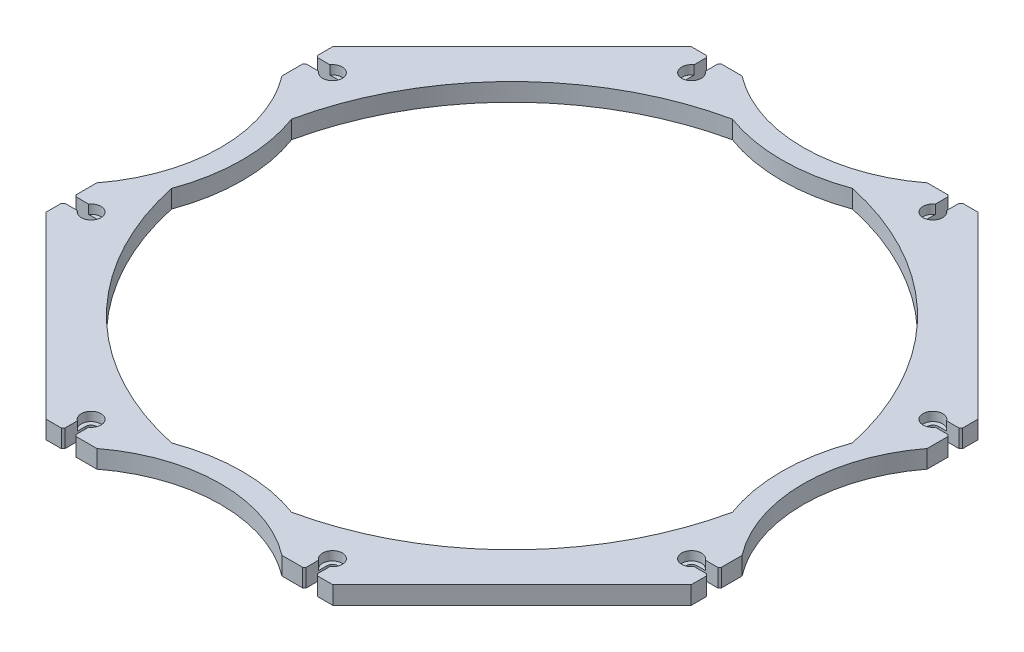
ISO-10303-21;
HEADER;
FILE_DESCRIPTION(('STEP AP214'),'2;1');
FILE_NAME('part.step','',(''),(''),'','','');
FILE_SCHEMA(('AUTOMOTIVE_DESIGN { 1 0 10303 214 1 1 1 1 }'));
ENDSEC;
DATA;
#1=APPLICATION_CONTEXT('core data for automotive mechanical design processes');
#2=APPLICATION_PROTOCOL_DEFINITION('international standard','automotive_design',2000,#1);
#3=PRODUCT_CONTEXT('',#1,'mechanical');
#4=PRODUCT('Part','Part','',(#3));
#5=PRODUCT_RELATED_PRODUCT_CATEGORY('part','',(#4));
#6=PRODUCT_DEFINITION_FORMATION('','',#4);
#7=PRODUCT_DEFINITION_CONTEXT('part definition',#1,'design');
#8=PRODUCT_DEFINITION('design','',#6,#7);
#9=PRODUCT_DEFINITION_SHAPE('','',#8);
#10=(LENGTH_UNIT() NAMED_UNIT(*) SI_UNIT(.MILLI.,.METRE.));
#11=(NAMED_UNIT(*) PLANE_ANGLE_UNIT() SI_UNIT($,.RADIAN.));
#12=(NAMED_UNIT(*) SI_UNIT($,.STERADIAN.) SOLID_ANGLE_UNIT());
#13=UNCERTAINTY_MEASURE_WITH_UNIT(LENGTH_MEASURE(1.E-05),#10,'distance_accuracy_value','');
#14=(GEOMETRIC_REPRESENTATION_CONTEXT(3) GLOBAL_UNCERTAINTY_ASSIGNED_CONTEXT((#13)) GLOBAL_UNIT_ASSIGNED_CONTEXT((#10,
#11,#12)) REPRESENTATION_CONTEXT('',''));
#15=CARTESIAN_POINT('',(0.,0.,0.));
#16=DIRECTION('',(0.,0.,1.));
#17=DIRECTION('',(1.,0.,0.));
#18=AXIS2_PLACEMENT_3D('',#15,#16,#17);
#19=CARTESIAN_POINT('',(143.103600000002,0.,-15.8749999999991));
#20=DIRECTION('',(0.,1.,0.));
#21=DIRECTION('',(0.,0.,1.));
#22=AXIS2_PLACEMENT_3D('',#19,#20,#21);
#23=CYLINDRICAL_SURFACE('',#22,3.96875000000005);
#24=CARTESIAN_POINT('',(143.103600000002,6.35,-15.8749999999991));
#25=DIRECTION('',(0.,1.,0.));
#26=DIRECTION('',(0.,0.,1.));
#27=AXIS2_PLACEMENT_3D('',#24,#25,#26);
#28=CIRCLE('',#27,3.96875000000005);
#29=CARTESIAN_POINT('',(139.134850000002,6.35,-15.874999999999));
#30=VERTEX_POINT('',#29);
#31=CARTESIAN_POINT('',(147.072350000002,6.35,-15.8749999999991));
#32=VERTEX_POINT('',#31);
#33=EDGE_CURVE('E656',#30,#32,#28,.F.);
#34=ORIENTED_EDGE('',*,*,#33,.F.);
#35=DIRECTION('',(0.,1.,0.));
#36=VECTOR('',#35,1.);
#37=CARTESIAN_POINT('',(139.134850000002,0.,-15.874999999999));
#38=LINE('',#37,#36);
#39=CARTESIAN_POINT('',(139.134850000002,0.,-15.874999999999));
#40=VERTEX_POINT('',#39);
#41=EDGE_CURVE('E754',#40,#30,#38,.T.);
#42=ORIENTED_EDGE('',*,*,#41,.F.);
#43=CARTESIAN_POINT('',(143.103600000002,0.,-15.8749999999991));
#44=DIRECTION('',(0.,1.,0.));
#45=DIRECTION('',(-1.,0.,0.));
#46=AXIS2_PLACEMENT_3D('',#43,#44,#45);
#47=CIRCLE('',#46,3.96875000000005);
#48=CARTESIAN_POINT('',(147.072350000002,0.,-15.8749999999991));
#49=VERTEX_POINT('',#48);
#50=EDGE_CURVE('E743',#49,#40,#47,.T.);
#51=ORIENTED_EDGE('',*,*,#50,.F.);
#52=DIRECTION('',(0.,1.,0.));
#53=VECTOR('',#52,1.);
#54=CARTESIAN_POINT('',(147.072350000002,0.,-15.8749999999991));
#55=LINE('',#54,#53);
#56=EDGE_CURVE('E757',#49,#32,#55,.T.);
#57=ORIENTED_EDGE('',*,*,#56,.T.);
#58=EDGE_LOOP('',(#34,#42,#51,#57));
#59=FACE_BOUND('',#58,.T.);
#60=ADVANCED_FACE('F31',(#59),#23,.F.);
#61=CARTESIAN_POINT('',(314.096400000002,0.,-15.8750000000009));
#62=DIRECTION('',(0.,1.,0.));
#63=DIRECTION('',(0.,0.,1.));
#64=AXIS2_PLACEMENT_3D('',#61,#62,#63);
#65=CYLINDRICAL_SURFACE('',#64,3.96875000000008);
#66=CARTESIAN_POINT('',(314.096400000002,6.35,-15.8750000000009));
#67=DIRECTION('',(0.,1.,0.));
#68=DIRECTION('',(0.,0.,1.));
#69=AXIS2_PLACEMENT_3D('',#66,#67,#68);
#70=CIRCLE('',#69,3.96875000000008);
#71=CARTESIAN_POINT('',(310.127650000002,6.35,-15.8750000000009));
#72=VERTEX_POINT('',#71);
#73=CARTESIAN_POINT('',(318.065150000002,6.35,-15.8750000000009));
#74=VERTEX_POINT('',#73);
#75=EDGE_CURVE('E668',#72,#74,#70,.F.);
#76=ORIENTED_EDGE('',*,*,#75,.F.);
#77=DIRECTION('',(0.,1.,0.));
#78=VECTOR('',#77,1.);
#79=CARTESIAN_POINT('',(310.127650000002,0.,-15.8750000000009));
#80=LINE('',#79,#78);
#81=CARTESIAN_POINT('',(310.127650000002,0.,-15.8750000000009));
#82=VERTEX_POINT('',#81);
#83=EDGE_CURVE('E813',#82,#72,#80,.T.);
#84=ORIENTED_EDGE('',*,*,#83,.F.);
#85=CARTESIAN_POINT('',(314.096400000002,0.,-15.8750000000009));
#86=DIRECTION('',(0.,1.,0.));
#87=DIRECTION('',(-1.,0.,0.));
#88=AXIS2_PLACEMENT_3D('',#85,#86,#87);
#89=CIRCLE('',#88,3.96875000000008);
#90=CARTESIAN_POINT('',(318.065150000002,0.,-15.8750000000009));
#91=VERTEX_POINT('',#90);
#92=EDGE_CURVE('E794',#91,#82,#89,.T.);
#93=ORIENTED_EDGE('',*,*,#92,.F.);
#94=DIRECTION('',(0.,1.,0.));
#95=VECTOR('',#94,1.);
#96=CARTESIAN_POINT('',(318.065150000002,0.,-15.8750000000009));
#97=LINE('',#96,#95);
#98=EDGE_CURVE('E816',#91,#74,#97,.T.);
#99=ORIENTED_EDGE('',*,*,#98,.T.);
#100=EDGE_LOOP('',(#76,#84,#93,#99));
#101=FACE_BOUND('',#100,.T.);
#102=ADVANCED_FACE('F1454',(#101),#65,.F.);
#103=CARTESIAN_POINT('',(15.8749999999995,0.,-314.096399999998));
#104=DIRECTION('',(0.,1.,0.));
#105=DIRECTION('',(0.,0.,1.));
#106=AXIS2_PLACEMENT_3D('',#103,#104,#105);
#107=CYLINDRICAL_SURFACE('',#106,3.96875000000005);
#108=CARTESIAN_POINT('',(15.8749999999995,6.35,-314.096399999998));
#109=DIRECTION('',(0.,1.,0.));
#110=DIRECTION('',(0.,0.,1.));
#111=AXIS2_PLACEMENT_3D('',#108,#109,#110);
#112=CIRCLE('',#111,3.96875000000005);
#113=CARTESIAN_POINT('',(15.8749999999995,6.35,-318.065149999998));
#114=VERTEX_POINT('',#113);
#115=CARTESIAN_POINT('',(15.8749999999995,6.35,-310.127649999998));
#116=VERTEX_POINT('',#115);
#117=EDGE_CURVE('E680',#114,#116,#112,.F.);
#118=ORIENTED_EDGE('',*,*,#117,.F.);
#119=DIRECTION('',(0.,1.,0.));
#120=VECTOR('',#119,1.);
#121=CARTESIAN_POINT('',(15.8749999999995,0.,-318.065149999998));
#122=LINE('',#121,#120);
#123=CARTESIAN_POINT('',(15.8749999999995,0.,-318.065149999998));
#124=VERTEX_POINT('',#123);
#125=EDGE_CURVE('E850',#124,#114,#122,.T.);
#126=ORIENTED_EDGE('',*,*,#125,.F.);
#127=CARTESIAN_POINT('',(15.8749999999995,0.,-314.096399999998));
#128=DIRECTION('',(0.,1.,0.));
#129=DIRECTION('',(0.,0.,-1.));
#130=AXIS2_PLACEMENT_3D('',#127,#128,#129);
#131=CIRCLE('',#130,3.96875000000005);
#132=CARTESIAN_POINT('',(15.8749999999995,0.,-310.127649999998));
#133=VERTEX_POINT('',#132);
#134=EDGE_CURVE('E839',#133,#124,#131,.T.);
#135=ORIENTED_EDGE('',*,*,#134,.F.);
#136=DIRECTION('',(0.,1.,0.));
#137=VECTOR('',#136,1.);
#138=CARTESIAN_POINT('',(15.8749999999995,0.,-310.127649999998));
#139=LINE('',#138,#137);
#140=EDGE_CURVE('E853',#133,#116,#139,.T.);
#141=ORIENTED_EDGE('',*,*,#140,.T.);
#142=EDGE_LOOP('',(#118,#126,#135,#141));
#143=FACE_BOUND('',#142,.T.);
#144=ADVANCED_FACE('F1428',(#143),#107,.F.);
#145=CARTESIAN_POINT('',(15.8750000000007,0.,-143.103599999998));
#146=DIRECTION('',(0.,1.,0.));
#147=DIRECTION('',(0.,0.,1.));
#148=AXIS2_PLACEMENT_3D('',#145,#146,#147);
#149=CYLINDRICAL_SURFACE('',#148,3.96875000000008);
#150=CARTESIAN_POINT('',(15.8750000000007,6.35,-143.103599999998));
#151=DIRECTION('',(0.,1.,0.));
#152=DIRECTION('',(0.,0.,1.));
#153=AXIS2_PLACEMENT_3D('',#150,#151,#152);
#154=CIRCLE('',#153,3.96875000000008);
#155=CARTESIAN_POINT('',(15.8750000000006,6.35,-147.072349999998));
#156=VERTEX_POINT('',#155);
#157=CARTESIAN_POINT('',(15.8750000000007,6.35,-139.134849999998));
#158=VERTEX_POINT('',#157);
#159=EDGE_CURVE('E692',#156,#158,#154,.F.);
#160=ORIENTED_EDGE('',*,*,#159,.F.);
#161=DIRECTION('',(0.,1.,0.));
#162=VECTOR('',#161,1.);
#163=CARTESIAN_POINT('',(15.8750000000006,0.,-147.072349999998));
#164=LINE('',#163,#162);
#165=CARTESIAN_POINT('',(15.8750000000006,0.,-147.072349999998));
#166=VERTEX_POINT('',#165);
#167=EDGE_CURVE('E909',#166,#156,#164,.T.);
#168=ORIENTED_EDGE('',*,*,#167,.F.);
#169=CARTESIAN_POINT('',(15.8750000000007,0.,-143.103599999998));
#170=DIRECTION('',(0.,1.,0.));
#171=DIRECTION('',(0.,0.,-1.));
#172=AXIS2_PLACEMENT_3D('',#169,#170,#171);
#173=CIRCLE('',#172,3.96875000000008);
#174=CARTESIAN_POINT('',(15.8750000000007,0.,-139.134849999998));
#175=VERTEX_POINT('',#174);
#176=EDGE_CURVE('E890',#175,#166,#173,.T.);
#177=ORIENTED_EDGE('',*,*,#176,.F.);
#178=DIRECTION('',(0.,1.,0.));
#179=VECTOR('',#178,1.);
#180=CARTESIAN_POINT('',(15.8750000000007,0.,-139.134849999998));
#181=LINE('',#180,#179);
#182=EDGE_CURVE('E912',#175,#158,#181,.T.);
#183=ORIENTED_EDGE('',*,*,#182,.T.);
#184=EDGE_LOOP('',(#160,#168,#177,#183));
#185=FACE_BOUND('',#184,.T.);
#186=ADVANCED_FACE('F1495',(#185),#149,.F.);
#187=CARTESIAN_POINT('',(314.096399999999,0.,-441.325));
#188=DIRECTION('',(0.,1.,0.));
#189=DIRECTION('',(0.,0.,1.));
#190=AXIS2_PLACEMENT_3D('',#187,#188,#189);
#191=CYLINDRICAL_SURFACE('',#190,3.96875000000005);
#192=CARTESIAN_POINT('',(314.096399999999,6.35,-441.325));
#193=DIRECTION('',(0.,1.,0.));
#194=DIRECTION('',(0.,0.,1.));
#195=AXIS2_PLACEMENT_3D('',#192,#193,#194);
#196=CIRCLE('',#195,3.96875000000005);
#197=CARTESIAN_POINT('',(318.065149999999,6.35,-441.325));
#198=VERTEX_POINT('',#197);
#199=CARTESIAN_POINT('',(310.127649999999,6.35,-441.325));
#200=VERTEX_POINT('',#199);
#201=EDGE_CURVE('E704',#198,#200,#196,.F.);
#202=ORIENTED_EDGE('',*,*,#201,.F.);
#203=DIRECTION('',(0.,1.,0.));
#204=VECTOR('',#203,1.);
#205=CARTESIAN_POINT('',(318.065149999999,0.,-441.325));
#206=LINE('',#205,#204);
#207=CARTESIAN_POINT('',(318.065149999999,0.,-441.325));
#208=VERTEX_POINT('',#207);
#209=EDGE_CURVE('E946',#208,#198,#206,.T.);
#210=ORIENTED_EDGE('',*,*,#209,.F.);
#211=CARTESIAN_POINT('',(314.096399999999,0.,-441.325));
#212=DIRECTION('',(0.,1.,0.));
#213=DIRECTION('',(1.,0.,0.));
#214=AXIS2_PLACEMENT_3D('',#211,#212,#213);
#215=CIRCLE('',#214,3.96875000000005);
#216=CARTESIAN_POINT('',(310.127649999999,0.,-441.325));
#217=VERTEX_POINT('',#216);
#218=EDGE_CURVE('E935',#217,#208,#215,.T.);
#219=ORIENTED_EDGE('',*,*,#218,.F.);
#220=DIRECTION('',(0.,1.,0.));
#221=VECTOR('',#220,1.);
#222=CARTESIAN_POINT('',(310.127649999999,0.,-441.325));
#223=LINE('',#222,#221);
#224=EDGE_CURVE('E949',#217,#200,#223,.T.);
#225=ORIENTED_EDGE('',*,*,#224,.T.);
#226=EDGE_LOOP('',(#202,#210,#219,#225));
#227=FACE_BOUND('',#226,.T.);
#228=ADVANCED_FACE('F1375',(#227),#191,.F.);
#229=CARTESIAN_POINT('',(143.103599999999,0.,-441.325));
#230=DIRECTION('',(0.,1.,0.));
#231=DIRECTION('',(0.,0.,1.));
#232=AXIS2_PLACEMENT_3D('',#229,#230,#231);
#233=CYLINDRICAL_SURFACE('',#232,3.96875000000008);
#234=CARTESIAN_POINT('',(143.103599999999,6.35,-441.325));
#235=DIRECTION('',(0.,1.,0.));
#236=DIRECTION('',(0.,0.,1.));
#237=AXIS2_PLACEMENT_3D('',#234,#235,#236);
#238=CIRCLE('',#237,3.96875000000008);
#239=CARTESIAN_POINT('',(147.072349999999,6.35,-441.325));
#240=VERTEX_POINT('',#239);
#241=CARTESIAN_POINT('',(139.134849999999,6.35,-441.325));
#242=VERTEX_POINT('',#241);
#243=EDGE_CURVE('E716',#240,#242,#238,.F.);
#244=ORIENTED_EDGE('',*,*,#243,.F.);
#245=DIRECTION('',(0.,1.,0.));
#246=VECTOR('',#245,1.);
#247=CARTESIAN_POINT('',(147.072349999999,0.,-441.325));
#248=LINE('',#247,#246);
#249=CARTESIAN_POINT('',(147.072349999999,0.,-441.325));
#250=VERTEX_POINT('',#249);
#251=EDGE_CURVE('E1005',#250,#240,#248,.T.);
#252=ORIENTED_EDGE('',*,*,#251,.F.);
#253=CARTESIAN_POINT('',(143.103599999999,0.,-441.325));
#254=DIRECTION('',(0.,1.,0.));
#255=DIRECTION('',(1.,0.,0.));
#256=AXIS2_PLACEMENT_3D('',#253,#254,#255);
#257=CIRCLE('',#256,3.96875000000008);
#258=CARTESIAN_POINT('',(139.134849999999,0.,-441.325));
#259=VERTEX_POINT('',#258);
#260=EDGE_CURVE('E986',#259,#250,#257,.T.);
#261=ORIENTED_EDGE('',*,*,#260,.F.);
#262=DIRECTION('',(0.,1.,0.));
#263=VECTOR('',#262,1.);
#264=CARTESIAN_POINT('',(139.134849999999,0.,-441.325));
#265=LINE('',#264,#263);
#266=EDGE_CURVE('E1008',#259,#242,#265,.T.);
#267=ORIENTED_EDGE('',*,*,#266,.T.);
#268=EDGE_LOOP('',(#244,#252,#261,#267));
#269=FACE_BOUND('',#268,.T.);
#270=ADVANCED_FACE('F1529',(#269),#233,.F.);
#271=CARTESIAN_POINT('',(0.,12.7,0.));
#272=DIRECTION('',(0.,0.,-1.));
#273=DIRECTION('',(-1.,0.,0.));
#274=AXIS2_PLACEMENT_3D('',#271,#272,#273);
#275=PLANE('',#274);
#276=DIRECTION('',(1.,0.,0.));
#277=VECTOR('',#276,1.);
#278=CARTESIAN_POINT('',(0.,12.7,0.));
#279=LINE('',#278,#277);
#280=CARTESIAN_POINT('',(127.,12.7,0.));
#281=VERTEX_POINT('',#280);
#282=CARTESIAN_POINT('',(137.864850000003,12.7,9.43689570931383E-13));
#283=VERTEX_POINT('',#282);
#284=EDGE_CURVE('E1152',#281,#283,#279,.T.);
#285=ORIENTED_EDGE('',*,*,#284,.F.);
#286=DIRECTION('',(0.,-1.,0.));
#287=VECTOR('',#286,1.);
#288=CARTESIAN_POINT('',(127.,12.7,0.));
#289=LINE('',#288,#287);
#290=CARTESIAN_POINT('',(127.,0.,0.));
#291=VERTEX_POINT('',#290);
#292=EDGE_CURVE('E39',#281,#291,#289,.T.);
#293=ORIENTED_EDGE('',*,*,#292,.T.);
#294=DIRECTION('',(1.,0.,0.));
#295=VECTOR('',#294,1.);
#296=CARTESIAN_POINT('',(0.,0.,0.));
#297=LINE('',#296,#295);
#298=CARTESIAN_POINT('',(137.864850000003,0.,9.43689570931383E-13));
#299=VERTEX_POINT('',#298);
#300=EDGE_CURVE('E1136',#291,#299,#297,.T.);
#301=ORIENTED_EDGE('',*,*,#300,.T.);
#302=DIRECTION('',(0.,1.,0.));
#303=VECTOR('',#302,1.);
#304=CARTESIAN_POINT('',(137.864850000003,0.,9.43689570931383E-13));
#305=LINE('',#304,#303);
#306=EDGE_CURVE('E749',#299,#283,#305,.T.);
#307=ORIENTED_EDGE('',*,*,#306,.T.);
#308=EDGE_LOOP('',(#285,#293,#301,#307));
#309=FACE_BOUND('',#308,.T.);
#310=ADVANCED_FACE('F1236',(#309),#275,.F.);
#311=CARTESIAN_POINT('',(148.342350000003,12.7,8.32667268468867E-13));
#312=VERTEX_POINT('',#311);
#313=CARTESIAN_POINT('',(162.991868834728,12.7,0.));
#314=VERTEX_POINT('',#313);
#315=EDGE_CURVE('E1155',#312,#314,#279,.T.);
#316=ORIENTED_EDGE('',*,*,#315,.F.);
#317=DIRECTION('',(0.,1.,0.));
#318=VECTOR('',#317,1.);
#319=CARTESIAN_POINT('',(148.342350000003,0.,8.32667268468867E-13));
#320=LINE('',#319,#318);
#321=CARTESIAN_POINT('',(148.342350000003,0.,8.32667268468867E-13));
#322=VERTEX_POINT('',#321);
#323=EDGE_CURVE('E762',#322,#312,#320,.T.);
#324=ORIENTED_EDGE('',*,*,#323,.F.);
#325=CARTESIAN_POINT('',(162.991868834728,0.,0.));
#326=VERTEX_POINT('',#325);
#327=EDGE_CURVE('E1139',#322,#326,#297,.T.);
#328=ORIENTED_EDGE('',*,*,#327,.T.);
#329=DIRECTION('',(0.,1.,0.));
#330=VECTOR('',#329,1.);
#331=CARTESIAN_POINT('',(162.991868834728,0.,0.));
#332=LINE('',#331,#330);
#333=EDGE_CURVE('E774',#326,#314,#332,.T.);
#334=ORIENTED_EDGE('',*,*,#333,.T.);
#335=EDGE_LOOP('',(#316,#324,#328,#334));
#336=FACE_BOUND('',#335,.T.);
#337=ADVANCED_FACE('F1275',(#336),#275,.F.);
#338=CARTESIAN_POINT('',(319.335150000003,0.,-9.43689570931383E-13));
#339=VERTEX_POINT('',#338);
#340=CARTESIAN_POINT('',(330.199999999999,0.,0.));
#341=VERTEX_POINT('',#340);
#342=EDGE_CURVE('E1134',#339,#341,#297,.T.);
#343=ORIENTED_EDGE('',*,*,#342,.T.);
#344=DIRECTION('',(0.,1.,0.));
#345=VECTOR('',#344,1.);
#346=CARTESIAN_POINT('',(330.2,12.7,0.));
#347=LINE('',#346,#345);
#348=CARTESIAN_POINT('',(330.2,12.7,0.));
#349=VERTEX_POINT('',#348);
#350=EDGE_CURVE('E1231',#341,#349,#347,.T.);
#351=ORIENTED_EDGE('',*,*,#350,.T.);
#352=CARTESIAN_POINT('',(319.335150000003,12.7,-9.43689570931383E-13));
#353=VERTEX_POINT('',#352);
#354=EDGE_CURVE('E1150',#353,#349,#279,.T.);
#355=ORIENTED_EDGE('',*,*,#354,.F.);
#356=DIRECTION('',(0.,1.,0.));
#357=VECTOR('',#356,1.);
#358=CARTESIAN_POINT('',(319.335150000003,0.,-9.43689570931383E-13));
#359=LINE('',#358,#357);
#360=EDGE_CURVE('E804',#339,#353,#359,.T.);
#361=ORIENTED_EDGE('',*,*,#360,.F.);
#362=EDGE_LOOP('',(#343,#351,#355,#361));
#363=FACE_BOUND('',#362,.T.);
#364=ADVANCED_FACE('F1622',(#363),#275,.F.);
#365=CARTESIAN_POINT('',(0.,12.7,0.));
#366=DIRECTION('',(1.,0.,0.));
#367=DIRECTION('',(0.,0.,-1.));
#368=AXIS2_PLACEMENT_3D('',#365,#366,#367);
#369=PLANE('',#368);
#370=DIRECTION('',(0.,0.,1.));
#371=VECTOR('',#370,1.);
#372=CARTESIAN_POINT('',(0.,12.7,0.));
#373=LINE('',#372,#371);
#374=CARTESIAN_POINT('',(0.,12.7,-330.2));
#375=VERTEX_POINT('',#374);
#376=CARTESIAN_POINT('',(-5.55111512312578E-13,12.7,-319.335149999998));
#377=VERTEX_POINT('',#376);
#378=EDGE_CURVE('E1148',#375,#377,#373,.T.);
#379=ORIENTED_EDGE('',*,*,#378,.F.);
#380=DIRECTION('',(0.,-1.,0.));
#381=VECTOR('',#380,1.);
#382=CARTESIAN_POINT('',(0.,12.7,-330.2));
#383=LINE('',#382,#381);
#384=CARTESIAN_POINT('',(0.,0.,-330.2));
#385=VERTEX_POINT('',#384);
#386=EDGE_CURVE('E1203',#375,#385,#383,.T.);
#387=ORIENTED_EDGE('',*,*,#386,.T.);
#388=DIRECTION('',(0.,0.,1.));
#389=VECTOR('',#388,1.);
#390=CARTESIAN_POINT('',(0.,0.,0.));
#391=LINE('',#390,#389);
#392=CARTESIAN_POINT('',(-5.55111512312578E-13,0.,-319.335149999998));
#393=VERTEX_POINT('',#392);
#394=EDGE_CURVE('E1132',#385,#393,#391,.T.);
#395=ORIENTED_EDGE('',*,*,#394,.T.);
#396=DIRECTION('',(0.,1.,0.));
#397=VECTOR('',#396,1.);
#398=CARTESIAN_POINT('',(-5.55111512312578E-13,0.,-319.335149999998));
#399=LINE('',#398,#397);
#400=EDGE_CURVE('E845',#393,#377,#399,.T.);
#401=ORIENTED_EDGE('',*,*,#400,.T.);
#402=EDGE_LOOP('',(#379,#387,#395,#401));
#403=FACE_BOUND('',#402,.T.);
#404=ADVANCED_FACE('F1402',(#403),#369,.F.);
#405=CARTESIAN_POINT('',(-4.44089209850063E-13,12.7,-308.857649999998));
#406=VERTEX_POINT('',#405);
#407=CARTESIAN_POINT('',(0.,12.7,-294.208131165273));
#408=VERTEX_POINT('',#407);
#409=EDGE_CURVE('E1151',#406,#408,#373,.T.);
#410=ORIENTED_EDGE('',*,*,#409,.F.);
#411=DIRECTION('',(0.,1.,0.));
#412=VECTOR('',#411,1.);
#413=CARTESIAN_POINT('',(-4.44089209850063E-13,0.,-308.857649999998));
#414=LINE('',#413,#412);
#415=CARTESIAN_POINT('',(-4.44089209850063E-13,0.,-308.857649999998));
#416=VERTEX_POINT('',#415);
#417=EDGE_CURVE('E858',#416,#406,#414,.T.);
#418=ORIENTED_EDGE('',*,*,#417,.F.);
#419=CARTESIAN_POINT('',(0.,0.,-294.208131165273));
#420=VERTEX_POINT('',#419);
#421=EDGE_CURVE('E1135',#416,#420,#391,.T.);
#422=ORIENTED_EDGE('',*,*,#421,.T.);
#423=DIRECTION('',(0.,1.,0.));
#424=VECTOR('',#423,1.);
#425=CARTESIAN_POINT('',(0.,0.,-294.208131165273));
#426=LINE('',#425,#424);
#427=EDGE_CURVE('E870',#420,#408,#426,.T.);
#428=ORIENTED_EDGE('',*,*,#427,.T.);
#429=EDGE_LOOP('',(#410,#418,#422,#428));
#430=FACE_BOUND('',#429,.T.);
#431=ADVANCED_FACE('F1438',(#430),#369,.F.);
#432=CARTESIAN_POINT('',(7.21644966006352E-13,0.,-137.864849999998));
#433=VERTEX_POINT('',#432);
#434=CARTESIAN_POINT('',(0.,0.,-127.));
#435=VERTEX_POINT('',#434);
#436=EDGE_CURVE('E1118',#433,#435,#391,.T.);
#437=ORIENTED_EDGE('',*,*,#436,.T.);
#438=DIRECTION('',(0.,1.,0.));
#439=VECTOR('',#438,1.);
#440=CARTESIAN_POINT('',(0.,12.7,-127.));
#441=LINE('',#440,#439);
#442=CARTESIAN_POINT('',(0.,12.7,-127.));
#443=VERTEX_POINT('',#442);
#444=EDGE_CURVE('E11',#435,#443,#441,.T.);
#445=ORIENTED_EDGE('',*,*,#444,.T.);
#446=CARTESIAN_POINT('',(7.21644966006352E-13,12.7,-137.864849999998));
#447=VERTEX_POINT('',#446);
#448=EDGE_CURVE('E1146',#447,#443,#373,.T.);
#449=ORIENTED_EDGE('',*,*,#448,.F.);
#450=DIRECTION('',(0.,1.,0.));
#451=VECTOR('',#450,1.);
#452=CARTESIAN_POINT('',(7.21644966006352E-13,0.,-137.864849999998));
#453=LINE('',#452,#451);
#454=EDGE_CURVE('E900',#433,#447,#453,.T.);
#455=ORIENTED_EDGE('',*,*,#454,.F.);
#456=EDGE_LOOP('',(#437,#445,#449,#455));
#457=FACE_BOUND('',#456,.T.);
#458=ADVANCED_FACE('F1627',(#457),#369,.F.);
#459=CARTESIAN_POINT('',(0.,12.7,-457.2));
#460=DIRECTION('',(0.,0.,1.));
#461=DIRECTION('',(1.,0.,0.));
#462=AXIS2_PLACEMENT_3D('',#459,#460,#461);
#463=PLANE('',#462);
#464=DIRECTION('',(-1.,0.,0.));
#465=VECTOR('',#464,1.);
#466=CARTESIAN_POINT('',(0.,12.7,-457.2));
#467=LINE('',#466,#465);
#468=CARTESIAN_POINT('',(330.2,12.7,-457.2));
#469=VERTEX_POINT('',#468);
#470=CARTESIAN_POINT('',(319.335149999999,12.7,-457.2));
#471=VERTEX_POINT('',#470);
#472=EDGE_CURVE('E1160',#469,#471,#467,.T.);
#473=ORIENTED_EDGE('',*,*,#472,.F.);
#474=DIRECTION('',(0.,-1.,0.));
#475=VECTOR('',#474,1.);
#476=CARTESIAN_POINT('',(330.2,12.7,-457.2));
#477=LINE('',#476,#475);
#478=CARTESIAN_POINT('',(330.2,0.,-457.2));
#479=VERTEX_POINT('',#478);
#480=EDGE_CURVE('E1223',#469,#479,#477,.T.);
#481=ORIENTED_EDGE('',*,*,#480,.T.);
#482=DIRECTION('',(-1.,0.,0.));
#483=VECTOR('',#482,1.);
#484=CARTESIAN_POINT('',(0.,0.,-457.2));
#485=LINE('',#484,#483);
#486=CARTESIAN_POINT('',(319.335149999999,0.,-457.2));
#487=VERTEX_POINT('',#486);
#488=EDGE_CURVE('E1144',#479,#487,#485,.T.);
#489=ORIENTED_EDGE('',*,*,#488,.T.);
#490=DIRECTION('',(0.,1.,0.));
#491=VECTOR('',#490,1.);
#492=CARTESIAN_POINT('',(319.335149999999,0.,-457.2));
#493=LINE('',#492,#491);
#494=EDGE_CURVE('E941',#487,#471,#493,.T.);
#495=ORIENTED_EDGE('',*,*,#494,.T.);
#496=EDGE_LOOP('',(#473,#481,#489,#495));
#497=FACE_BOUND('',#496,.T.);
#498=ADVANCED_FACE('F1349',(#497),#463,.F.);
#499=CARTESIAN_POINT('',(308.857649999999,12.7,-457.2));
#500=VERTEX_POINT('',#499);
#501=CARTESIAN_POINT('',(294.208131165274,12.7,-457.2));
#502=VERTEX_POINT('',#501);
#503=EDGE_CURVE('E1163',#500,#502,#467,.T.);
#504=ORIENTED_EDGE('',*,*,#503,.F.);
#505=DIRECTION('',(0.,1.,0.));
#506=VECTOR('',#505,1.);
#507=CARTESIAN_POINT('',(308.857649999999,0.,-457.2));
#508=LINE('',#507,#506);
#509=CARTESIAN_POINT('',(308.857649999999,0.,-457.2));
#510=VERTEX_POINT('',#509);
#511=EDGE_CURVE('E954',#510,#500,#508,.T.);
#512=ORIENTED_EDGE('',*,*,#511,.F.);
#513=CARTESIAN_POINT('',(294.208131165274,0.,-457.2));
#514=VERTEX_POINT('',#513);
#515=EDGE_CURVE('E1147',#510,#514,#485,.T.);
#516=ORIENTED_EDGE('',*,*,#515,.T.);
#517=DIRECTION('',(0.,1.,0.));
#518=VECTOR('',#517,1.);
#519=CARTESIAN_POINT('',(294.208131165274,0.,-457.2));
#520=LINE('',#519,#518);
#521=EDGE_CURVE('E966',#514,#502,#520,.T.);
#522=ORIENTED_EDGE('',*,*,#521,.T.);
#523=EDGE_LOOP('',(#504,#512,#516,#522));
#524=FACE_BOUND('',#523,.T.);
#525=ADVANCED_FACE('F1385',(#524),#463,.F.);
#526=CARTESIAN_POINT('',(137.864849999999,0.,-457.2));
#527=VERTEX_POINT('',#526);
#528=CARTESIAN_POINT('',(127.,0.,-457.2));
#529=VERTEX_POINT('',#528);
#530=EDGE_CURVE('E1142',#527,#529,#485,.T.);
#531=ORIENTED_EDGE('',*,*,#530,.T.);
#532=DIRECTION('',(0.,1.,0.));
#533=VECTOR('',#532,1.);
#534=CARTESIAN_POINT('',(127.,12.7,-457.2));
#535=LINE('',#534,#533);
#536=CARTESIAN_POINT('',(127.,12.7,-457.2));
#537=VERTEX_POINT('',#536);
#538=EDGE_CURVE('E1214',#529,#537,#535,.T.);
#539=ORIENTED_EDGE('',*,*,#538,.T.);
#540=CARTESIAN_POINT('',(137.864849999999,12.7,-457.2));
#541=VERTEX_POINT('',#540);
#542=EDGE_CURVE('E1158',#541,#537,#467,.T.);
#543=ORIENTED_EDGE('',*,*,#542,.F.);
#544=DIRECTION('',(0.,1.,0.));
#545=VECTOR('',#544,1.);
#546=CARTESIAN_POINT('',(137.864849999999,0.,-457.2));
#547=LINE('',#546,#545);
#548=EDGE_CURVE('E996',#527,#541,#547,.T.);
#549=ORIENTED_EDGE('',*,*,#548,.F.);
#550=EDGE_LOOP('',(#531,#539,#543,#549));
#551=FACE_BOUND('',#550,.T.);
#552=ADVANCED_FACE('F1576',(#551),#463,.F.);
#553=CARTESIAN_POINT('',(441.325,0.,-143.1036));
#554=DIRECTION('',(0.,1.,0.));
#555=DIRECTION('',(0.,0.,1.));
#556=AXIS2_PLACEMENT_3D('',#553,#554,#555);
#557=CYLINDRICAL_SURFACE('',#556,3.96875000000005);
#558=CARTESIAN_POINT('',(441.325,6.35,-143.1036));
#559=DIRECTION('',(0.,1.,0.));
#560=DIRECTION('',(0.,0.,1.));
#561=AXIS2_PLACEMENT_3D('',#558,#559,#560);
#562=CIRCLE('',#561,3.96875000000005);
#563=CARTESIAN_POINT('',(441.325,6.35,-139.13485));
#564=VERTEX_POINT('',#563);
#565=CARTESIAN_POINT('',(441.325,6.35,-147.07235));
#566=VERTEX_POINT('',#565);
#567=EDGE_CURVE('E1016',#564,#566,#562,.F.);
#568=ORIENTED_EDGE('',*,*,#567,.F.);
#569=DIRECTION('',(0.,1.,0.));
#570=VECTOR('',#569,1.);
#571=CARTESIAN_POINT('',(441.325,0.,-139.13485));
#572=LINE('',#571,#570);
#573=CARTESIAN_POINT('',(441.325,0.,-139.13485));
#574=VERTEX_POINT('',#573);
#575=EDGE_CURVE('E1066',#574,#564,#572,.T.);
#576=ORIENTED_EDGE('',*,*,#575,.F.);
#577=CARTESIAN_POINT('',(441.325,0.,-143.1036));
#578=DIRECTION('',(0.,1.,0.));
#579=DIRECTION('',(0.,0.,1.));
#580=AXIS2_PLACEMENT_3D('',#577,#578,#579);
#581=CIRCLE('',#580,3.96875000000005);
#582=CARTESIAN_POINT('',(441.325,0.,-147.07235));
#583=VERTEX_POINT('',#582);
#584=EDGE_CURVE('E1055',#583,#574,#581,.T.);
#585=ORIENTED_EDGE('',*,*,#584,.F.);
#586=DIRECTION('',(0.,1.,0.));
#587=VECTOR('',#586,1.);
#588=CARTESIAN_POINT('',(441.325,0.,-147.07235));
#589=LINE('',#588,#587);
#590=EDGE_CURVE('E1069',#583,#566,#589,.T.);
#591=ORIENTED_EDGE('',*,*,#590,.T.);
#592=EDGE_LOOP('',(#568,#576,#585,#591));
#593=FACE_BOUND('',#592,.T.);
#594=ADVANCED_FACE('F1320',(#593),#557,.F.);
#595=CARTESIAN_POINT('',(441.325,0.,-314.0964));
#596=DIRECTION('',(0.,1.,0.));
#597=DIRECTION('',(0.,0.,1.));
#598=AXIS2_PLACEMENT_3D('',#595,#596,#597);
#599=CYLINDRICAL_SURFACE('',#598,3.96875000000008);
#600=CARTESIAN_POINT('',(441.325,6.35,-314.0964));
#601=DIRECTION('',(0.,1.,0.));
#602=DIRECTION('',(0.,0.,1.));
#603=AXIS2_PLACEMENT_3D('',#600,#601,#602);
#604=CIRCLE('',#603,3.96875000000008);
#605=CARTESIAN_POINT('',(441.325,6.35,-310.12765));
#606=VERTEX_POINT('',#605);
#607=CARTESIAN_POINT('',(441.325,6.35,-318.06515));
#608=VERTEX_POINT('',#607);
#609=EDGE_CURVE('E1028',#606,#608,#604,.F.);
#610=ORIENTED_EDGE('',*,*,#609,.F.);
#611=DIRECTION('',(0.,1.,0.));
#612=VECTOR('',#611,1.);
#613=CARTESIAN_POINT('',(441.325,0.,-310.12765));
#614=LINE('',#613,#612);
#615=CARTESIAN_POINT('',(441.325,0.,-310.12765));
#616=VERTEX_POINT('',#615);
#617=EDGE_CURVE('E1125',#616,#606,#614,.T.);
#618=ORIENTED_EDGE('',*,*,#617,.F.);
#619=CARTESIAN_POINT('',(441.325,0.,-314.0964));
#620=DIRECTION('',(0.,1.,0.));
#621=DIRECTION('',(0.,0.,1.));
#622=AXIS2_PLACEMENT_3D('',#619,#620,#621);
#623=CIRCLE('',#622,3.96875000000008);
#624=CARTESIAN_POINT('',(441.325,0.,-318.06515));
#625=VERTEX_POINT('',#624);
#626=EDGE_CURVE('E1106',#625,#616,#623,.T.);
#627=ORIENTED_EDGE('',*,*,#626,.F.);
#628=DIRECTION('',(0.,1.,0.));
#629=VECTOR('',#628,1.);
#630=CARTESIAN_POINT('',(441.325,0.,-318.06515));
#631=LINE('',#630,#629);
#632=EDGE_CURVE('E1128',#625,#608,#631,.T.);
#633=ORIENTED_EDGE('',*,*,#632,.T.);
#634=EDGE_LOOP('',(#610,#618,#627,#633));
#635=FACE_BOUND('',#634,.T.);
#636=ADVANCED_FACE('F1575',(#635),#599,.F.);
#637=CARTESIAN_POINT('',(457.2,12.7,0.));
#638=DIRECTION('',(-1.,0.,0.));
#639=DIRECTION('',(0.,0.,1.));
#640=AXIS2_PLACEMENT_3D('',#637,#638,#639);
#641=PLANE('',#640);
#642=DIRECTION('',(0.,0.,-1.));
#643=VECTOR('',#642,1.);
#644=CARTESIAN_POINT('',(457.2,12.7,0.));
#645=LINE('',#644,#643);
#646=CARTESIAN_POINT('',(457.2,12.7,-127.));
#647=VERTEX_POINT('',#646);
#648=CARTESIAN_POINT('',(457.2,12.7,-137.86485));
#649=VERTEX_POINT('',#648);
#650=EDGE_CURVE('E1156',#647,#649,#645,.T.);
#651=ORIENTED_EDGE('',*,*,#650,.F.);
#652=DIRECTION('',(0.,-1.,0.));
#653=VECTOR('',#652,1.);
#654=CARTESIAN_POINT('',(457.2,12.7,-127.));
#655=LINE('',#654,#653);
#656=CARTESIAN_POINT('',(457.2,0.,-127.));
#657=VERTEX_POINT('',#656);
#658=EDGE_CURVE('E1228',#647,#657,#655,.T.);
#659=ORIENTED_EDGE('',*,*,#658,.T.);
#660=DIRECTION('',(0.,0.,-1.));
#661=VECTOR('',#660,1.);
#662=CARTESIAN_POINT('',(457.2,0.,0.));
#663=LINE('',#662,#661);
#664=CARTESIAN_POINT('',(457.2,0.,-137.86485));
#665=VERTEX_POINT('',#664);
#666=EDGE_CURVE('E1140',#657,#665,#663,.T.);
#667=ORIENTED_EDGE('',*,*,#666,.T.);
#668=DIRECTION('',(0.,1.,0.));
#669=VECTOR('',#668,1.);
#670=CARTESIAN_POINT('',(457.2,0.,-137.86485));
#671=LINE('',#670,#669);
#672=EDGE_CURVE('E1061',#665,#649,#671,.T.);
#673=ORIENTED_EDGE('',*,*,#672,.T.);
#674=EDGE_LOOP('',(#651,#659,#667,#673));
#675=FACE_BOUND('',#674,.T.);
#676=ADVANCED_FACE('F1294',(#675),#641,.F.);
#677=CARTESIAN_POINT('',(457.2,12.7,-148.34235));
#678=VERTEX_POINT('',#677);
#679=CARTESIAN_POINT('',(457.2,12.7,-162.991868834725));
#680=VERTEX_POINT('',#679);
#681=EDGE_CURVE('E1159',#678,#680,#645,.T.);
#682=ORIENTED_EDGE('',*,*,#681,.F.);
#683=DIRECTION('',(0.,1.,0.));
#684=VECTOR('',#683,1.);
#685=CARTESIAN_POINT('',(457.2,0.,-148.34235));
#686=LINE('',#685,#684);
#687=CARTESIAN_POINT('',(457.2,0.,-148.34235));
#688=VERTEX_POINT('',#687);
#689=EDGE_CURVE('E1074',#688,#678,#686,.T.);
#690=ORIENTED_EDGE('',*,*,#689,.F.);
#691=CARTESIAN_POINT('',(457.2,0.,-162.991868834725));
#692=VERTEX_POINT('',#691);
#693=EDGE_CURVE('E1143',#688,#692,#663,.T.);
#694=ORIENTED_EDGE('',*,*,#693,.T.);
#695=DIRECTION('',(0.,1.,0.));
#696=VECTOR('',#695,1.);
#697=CARTESIAN_POINT('',(457.2,0.,-162.991868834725));
#698=LINE('',#697,#696);
#699=EDGE_CURVE('E1086',#692,#680,#698,.T.);
#700=ORIENTED_EDGE('',*,*,#699,.T.);
#701=EDGE_LOOP('',(#682,#690,#694,#700));
#702=FACE_BOUND('',#701,.T.);
#703=ADVANCED_FACE('F1330',(#702),#641,.F.);
#704=CARTESIAN_POINT('',(457.2,0.,-319.33515));
#705=VERTEX_POINT('',#704);
#706=CARTESIAN_POINT('',(457.2,0.,-330.2));
#707=VERTEX_POINT('',#706);
#708=EDGE_CURVE('E1138',#705,#707,#663,.T.);
#709=ORIENTED_EDGE('',*,*,#708,.T.);
#710=DIRECTION('',(0.,1.,0.));
#711=VECTOR('',#710,1.);
#712=CARTESIAN_POINT('',(457.2,12.7,-330.2));
#713=LINE('',#712,#711);
#714=CARTESIAN_POINT('',(457.2,12.7,-330.199999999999));
#715=VERTEX_POINT('',#714);
#716=EDGE_CURVE('E1226',#707,#715,#713,.T.);
#717=ORIENTED_EDGE('',*,*,#716,.T.);
#718=CARTESIAN_POINT('',(457.2,12.7,-319.33515));
#719=VERTEX_POINT('',#718);
#720=EDGE_CURVE('E1154',#719,#715,#645,.T.);
#721=ORIENTED_EDGE('',*,*,#720,.F.);
#722=DIRECTION('',(0.,1.,0.));
#723=VECTOR('',#722,1.);
#724=CARTESIAN_POINT('',(457.2,0.,-319.33515));
#725=LINE('',#724,#723);
#726=EDGE_CURVE('E1116',#705,#719,#725,.T.);
#727=ORIENTED_EDGE('',*,*,#726,.F.);
#728=EDGE_LOOP('',(#709,#717,#721,#727));
#729=FACE_BOUND('',#728,.T.);
#730=ADVANCED_FACE('F1619',(#729),#641,.F.);
#731=CARTESIAN_POINT('',(0.,12.7,-162.991868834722));
#732=VERTEX_POINT('',#731);
#733=CARTESIAN_POINT('',(6.66133814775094E-13,12.7,-148.342349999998));
#734=VERTEX_POINT('',#733);
#735=EDGE_CURVE('E1440',#732,#734,#373,.T.);
#736=ORIENTED_EDGE('',*,*,#735,.F.);
#737=DIRECTION('',(0.,1.,0.));
#738=VECTOR('',#737,1.);
#739=CARTESIAN_POINT('',(0.,0.,-162.991868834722));
#740=LINE('',#739,#738);
#741=CARTESIAN_POINT('',(0.,0.,-162.991868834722));
#742=VERTEX_POINT('',#741);
#743=EDGE_CURVE('E867',#732,#742,#740,.F.);
#744=ORIENTED_EDGE('',*,*,#743,.T.);
#745=CARTESIAN_POINT('',(6.66133814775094E-13,0.,-148.342349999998));
#746=VERTEX_POINT('',#745);
#747=EDGE_CURVE('E1710',#742,#746,#391,.T.);
#748=ORIENTED_EDGE('',*,*,#747,.T.);
#749=DIRECTION('',(0.,1.,0.));
#750=VECTOR('',#749,1.);
#751=CARTESIAN_POINT('',(6.66133814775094E-13,0.,-148.342349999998));
#752=LINE('',#751,#750);
#753=EDGE_CURVE('E903',#746,#734,#752,.T.);
#754=ORIENTED_EDGE('',*,*,#753,.T.);
#755=EDGE_LOOP('',(#736,#744,#748,#754));
#756=FACE_BOUND('',#755,.T.);
#757=ADVANCED_FACE('F33',(#756),#369,.F.);
#758=CARTESIAN_POINT('',(294.208131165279,12.7,0.));
#759=VERTEX_POINT('',#758);
#760=CARTESIAN_POINT('',(308.857650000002,12.7,-8.32667268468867E-13));
#761=VERTEX_POINT('',#760);
#762=EDGE_CURVE('E1277',#759,#761,#279,.T.);
#763=ORIENTED_EDGE('',*,*,#762,.F.);
#764=DIRECTION('',(0.,1.,0.));
#765=VECTOR('',#764,1.);
#766=CARTESIAN_POINT('',(294.208131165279,0.,0.));
#767=LINE('',#766,#765);
#768=CARTESIAN_POINT('',(294.208131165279,0.,0.));
#769=VERTEX_POINT('',#768);
#770=EDGE_CURVE('E771',#759,#769,#767,.F.);
#771=ORIENTED_EDGE('',*,*,#770,.T.);
#772=CARTESIAN_POINT('',(308.857650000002,0.,-8.32667268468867E-13));
#773=VERTEX_POINT('',#772);
#774=EDGE_CURVE('E1634',#769,#773,#297,.T.);
#775=ORIENTED_EDGE('',*,*,#774,.T.);
#776=DIRECTION('',(0.,1.,0.));
#777=VECTOR('',#776,1.);
#778=CARTESIAN_POINT('',(308.857650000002,0.,-8.32667268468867E-13));
#779=LINE('',#778,#777);
#780=EDGE_CURVE('E807',#773,#761,#779,.T.);
#781=ORIENTED_EDGE('',*,*,#780,.T.);
#782=EDGE_LOOP('',(#763,#771,#775,#781));
#783=FACE_BOUND('',#782,.T.);
#784=ADVANCED_FACE('F1617',(#783),#275,.F.);
#785=CARTESIAN_POINT('',(457.2,12.7,-294.208131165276));
#786=VERTEX_POINT('',#785);
#787=CARTESIAN_POINT('',(457.2,12.7,-308.85765));
#788=VERTEX_POINT('',#787);
#789=EDGE_CURVE('E1332',#786,#788,#645,.T.);
#790=ORIENTED_EDGE('',*,*,#789,.F.);
#791=DIRECTION('',(0.,1.,0.));
#792=VECTOR('',#791,1.);
#793=CARTESIAN_POINT('',(457.2,0.,-294.208131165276));
#794=LINE('',#793,#792);
#795=CARTESIAN_POINT('',(457.2,0.,-294.208131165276));
#796=VERTEX_POINT('',#795);
#797=EDGE_CURVE('E1083',#786,#796,#794,.F.);
#798=ORIENTED_EDGE('',*,*,#797,.T.);
#799=CARTESIAN_POINT('',(457.2,0.,-308.85765));
#800=VERTEX_POINT('',#799);
#801=EDGE_CURVE('E2287',#796,#800,#663,.T.);
#802=ORIENTED_EDGE('',*,*,#801,.T.);
#803=DIRECTION('',(0.,1.,0.));
#804=VECTOR('',#803,1.);
#805=CARTESIAN_POINT('',(457.2,0.,-308.85765));
#806=LINE('',#805,#804);
#807=EDGE_CURVE('E1119',#800,#788,#806,.T.);
#808=ORIENTED_EDGE('',*,*,#807,.T.);
#809=EDGE_LOOP('',(#790,#798,#802,#808));
#810=FACE_BOUND('',#809,.T.);
#811=ADVANCED_FACE('F1614',(#810),#641,.F.);
#812=CARTESIAN_POINT('',(162.991868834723,12.7,-457.2));
#813=VERTEX_POINT('',#812);
#814=CARTESIAN_POINT('',(148.342349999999,12.7,-457.2));
#815=VERTEX_POINT('',#814);
#816=EDGE_CURVE('E1387',#813,#815,#467,.T.);
#817=ORIENTED_EDGE('',*,*,#816,.F.);
#818=DIRECTION('',(0.,1.,0.));
#819=VECTOR('',#818,1.);
#820=CARTESIAN_POINT('',(162.991868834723,0.,-457.2));
#821=LINE('',#820,#819);
#822=CARTESIAN_POINT('',(162.991868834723,0.,-457.2));
#823=VERTEX_POINT('',#822);
#824=EDGE_CURVE('E963',#813,#823,#821,.F.);
#825=ORIENTED_EDGE('',*,*,#824,.T.);
#826=CARTESIAN_POINT('',(148.342349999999,0.,-457.2));
#827=VERTEX_POINT('',#826);
#828=EDGE_CURVE('E1693',#823,#827,#485,.T.);
#829=ORIENTED_EDGE('',*,*,#828,.T.);
#830=DIRECTION('',(0.,1.,0.));
#831=VECTOR('',#830,1.);
#832=CARTESIAN_POINT('',(148.342349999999,0.,-457.2));
#833=LINE('',#832,#831);
#834=EDGE_CURVE('E999',#827,#815,#833,.T.);
#835=ORIENTED_EDGE('',*,*,#834,.T.);
#836=EDGE_LOOP('',(#817,#825,#829,#835));
#837=FACE_BOUND('',#836,.T.);
#838=ADVANCED_FACE('F1611',(#837),#463,.F.);
#839=CARTESIAN_POINT('',(0.,12.7,0.));
#840=DIRECTION('',(0.,-1.,0.));
#841=DIRECTION('',(0.,0.,-1.));
#842=AXIS2_PLACEMENT_3D('',#839,#840,#841);
#843=PLANE('',#842);
#844=CARTESIAN_POINT('',(228.6,12.7,-228.6));
#845=DIRECTION('',(0.,1.,0.));
#846=DIRECTION('',(0.,0.,1.));
#847=AXIS2_PLACEMENT_3D('',#844,#845,#846);
#848=CIRCLE('',#847,203.2);
#849=CARTESIAN_POINT('',(271.112818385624,12.7,-29.896954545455));
#850=VERTEX_POINT('',#849);
#851=CARTESIAN_POINT('',(427.303045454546,12.7,-186.087181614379));
#852=VERTEX_POINT('',#851);
#853=EDGE_CURVE('E592',#850,#852,#848,.T.);
#854=ORIENTED_EDGE('',*,*,#853,.F.);
#855=CARTESIAN_POINT('',(228.600000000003,12.7,85.725));
#856=DIRECTION('',(0.,-1.,0.));
#857=DIRECTION('',(0.,0.,1.));
#858=AXIS2_PLACEMENT_3D('',#855,#856,#857);
#859=CIRCLE('',#858,123.19);
#860=CARTESIAN_POINT('',(186.087181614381,12.7,-29.8969545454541));
#861=VERTEX_POINT('',#860);
#862=EDGE_CURVE('E596',#861,#850,#859,.T.);
#863=ORIENTED_EDGE('',*,*,#862,.F.);
#864=CARTESIAN_POINT('',(228.6,12.7,-228.6));
#865=DIRECTION('',(0.,1.,0.));
#866=DIRECTION('',(0.,0.,1.));
#867=AXIS2_PLACEMENT_3D('',#864,#865,#866);
#868=CIRCLE('',#867,203.2);
#869=CARTESIAN_POINT('',(29.8969545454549,12.7,-186.087181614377));
#870=VERTEX_POINT('',#869);
#871=EDGE_CURVE('E615',#870,#861,#868,.T.);
#872=ORIENTED_EDGE('',*,*,#871,.F.);
#873=CARTESIAN_POINT('',(-85.725,12.7,-228.599999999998));
#874=DIRECTION('',(0.,-1.,0.));
#875=DIRECTION('',(0.,0.,1.));
#876=AXIS2_PLACEMENT_3D('',#873,#874,#875);
#877=CIRCLE('',#876,123.19);
#878=CARTESIAN_POINT('',(29.8969545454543,12.7,-271.11281838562));
#879=VERTEX_POINT('',#878);
#880=EDGE_CURVE('E612',#879,#870,#877,.T.);
#881=ORIENTED_EDGE('',*,*,#880,.F.);
#882=CARTESIAN_POINT('',(228.6,12.7,-228.6));
#883=DIRECTION('',(0.,1.,0.));
#884=DIRECTION('',(0.,0.,1.));
#885=AXIS2_PLACEMENT_3D('',#882,#883,#884);
#886=CIRCLE('',#885,203.2);
#887=CARTESIAN_POINT('',(186.087181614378,12.7,-427.303045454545));
#888=VERTEX_POINT('',#887);
#889=EDGE_CURVE('E609',#888,#879,#886,.T.);
#890=ORIENTED_EDGE('',*,*,#889,.F.);
#891=CARTESIAN_POINT('',(228.599999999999,12.7,-542.925));
#892=DIRECTION('',(0.,-1.,0.));
#893=DIRECTION('',(0.,0.,1.));
#894=AXIS2_PLACEMENT_3D('',#891,#892,#893);
#895=CIRCLE('',#894,123.19);
#896=CARTESIAN_POINT('',(271.112818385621,12.7,-427.303045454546));
#897=VERTEX_POINT('',#896);
#898=EDGE_CURVE('E603',#897,#888,#895,.T.);
#899=ORIENTED_EDGE('',*,*,#898,.F.);
#900=CARTESIAN_POINT('',(228.6,12.7,-228.6));
#901=DIRECTION('',(0.,1.,0.));
#902=DIRECTION('',(0.,0.,1.));
#903=AXIS2_PLACEMENT_3D('',#900,#901,#902);
#904=CIRCLE('',#903,203.2);
#905=CARTESIAN_POINT('',(427.303045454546,12.7,-271.112818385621));
#906=VERTEX_POINT('',#905);
#907=EDGE_CURVE('E601',#906,#897,#904,.T.);
#908=ORIENTED_EDGE('',*,*,#907,.F.);
#909=CARTESIAN_POINT('',(542.925,12.7,-228.6));
#910=DIRECTION('',(0.,-1.,0.));
#911=DIRECTION('',(0.,0.,1.));
#912=AXIS2_PLACEMENT_3D('',#909,#910,#911);
#913=CIRCLE('',#912,123.19);
#914=EDGE_CURVE('E580',#852,#906,#913,.T.);
#915=ORIENTED_EDGE('',*,*,#914,.F.);
#916=EDGE_LOOP('',(#854,#863,#872,#881,#890,#899,#908,#915));
#917=FACE_BOUND('',#916,.T.);
#918=ORIENTED_EDGE('',*,*,#542,.T.);
#919=DIRECTION('',(0.707106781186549,0.,-0.707106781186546));
#920=VECTOR('',#919,1.);
#921=CARTESIAN_POINT('',(0.,12.7,-330.2));
#922=LINE('',#921,#920);
#923=EDGE_CURVE('E1221',#537,#375,#922,.F.);
#924=ORIENTED_EDGE('',*,*,#923,.T.);
#925=ORIENTED_EDGE('',*,*,#378,.T.);
#926=DIRECTION('',(-0.707106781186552,0.,-0.707106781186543));
#927=VECTOR('',#926,1.);
#928=CARTESIAN_POINT('',(1.26999999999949,12.7,-318.065149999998));
#929=LINE('',#928,#927);
#930=CARTESIAN_POINT('',(1.26999999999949,12.7,-318.065149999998));
#931=VERTEX_POINT('',#930);
#932=EDGE_CURVE('E806',#931,#377,#929,.T.);
#933=ORIENTED_EDGE('',*,*,#932,.F.);
#934=DIRECTION('',(-1.,0.,0.));
#935=VECTOR('',#934,1.);
#936=CARTESIAN_POINT('',(15.8749999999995,12.7,-318.065149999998));
#937=LINE('',#936,#935);
#938=CARTESIAN_POINT('',(10.1270222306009,12.7,-318.065149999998));
#939=VERTEX_POINT('',#938);
#940=EDGE_CURVE('E828',#939,#931,#937,.T.);
#941=ORIENTED_EDGE('',*,*,#940,.F.);
#942=CARTESIAN_POINT('',(15.8749999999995,12.7,-314.096399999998));
#943=DIRECTION('',(0.,1.,0.));
#944=DIRECTION('',(0.,0.,-1.));
#945=AXIS2_PLACEMENT_3D('',#942,#943,#944);
#946=CIRCLE('',#945,6.98500000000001);
#947=CARTESIAN_POINT('',(10.1270222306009,12.7,-310.127649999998));
#948=VERTEX_POINT('',#947);
#949=EDGE_CURVE('E675',#948,#939,#946,.T.);
#950=ORIENTED_EDGE('',*,*,#949,.F.);
#951=DIRECTION('',(1.,0.,0.));
#952=VECTOR('',#951,1.);
#953=CARTESIAN_POINT('',(15.8749999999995,12.7,-310.127649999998));
#954=LINE('',#953,#952);
#955=CARTESIAN_POINT('',(1.26999999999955,12.7,-310.127649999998));
#956=VERTEX_POINT('',#955);
#957=EDGE_CURVE('E825',#956,#948,#954,.T.);
#958=ORIENTED_EDGE('',*,*,#957,.F.);
#959=DIRECTION('',(0.707106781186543,0.,-0.707106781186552));
#960=VECTOR('',#959,1.);
#961=CARTESIAN_POINT('',(1.26999999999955,12.7,-310.127649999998));
#962=LINE('',#961,#960);
#963=EDGE_CURVE('E822',#406,#956,#962,.T.);
#964=ORIENTED_EDGE('',*,*,#963,.F.);
#965=ORIENTED_EDGE('',*,*,#409,.T.);
#966=CARTESIAN_POINT('',(-85.725,12.7,-228.599999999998));
#967=DIRECTION('',(0.,1.,0.));
#968=DIRECTION('',(0.,0.,-1.));
#969=AXIS2_PLACEMENT_3D('',#966,#967,#968);
#970=CIRCLE('',#969,107.95);
#971=EDGE_CURVE('E849',#732,#408,#970,.T.);
#972=ORIENTED_EDGE('',*,*,#971,.F.);
#973=ORIENTED_EDGE('',*,*,#735,.T.);
#974=DIRECTION('',(-0.707106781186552,0.,-0.707106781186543));
#975=VECTOR('',#974,1.);
#976=CARTESIAN_POINT('',(1.27000000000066,12.7,-147.072349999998));
#977=LINE('',#976,#975);
#978=CARTESIAN_POINT('',(1.27000000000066,12.7,-147.072349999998));
#979=VERTEX_POINT('',#978);
#980=EDGE_CURVE('E881',#979,#734,#977,.T.);
#981=ORIENTED_EDGE('',*,*,#980,.F.);
#982=DIRECTION('',(-1.,0.,0.));
#983=VECTOR('',#982,1.);
#984=CARTESIAN_POINT('',(15.8750000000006,12.7,-147.072349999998));
#985=LINE('',#984,#983);
#986=CARTESIAN_POINT('',(10.1270222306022,12.7,-147.072349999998));
#987=VERTEX_POINT('',#986);
#988=EDGE_CURVE('E879',#987,#979,#985,.T.);
#989=ORIENTED_EDGE('',*,*,#988,.F.);
#990=CARTESIAN_POINT('',(15.8750000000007,12.7,-143.103599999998));
#991=DIRECTION('',(0.,1.,0.));
#992=DIRECTION('',(0.,0.,-1.));
#993=AXIS2_PLACEMENT_3D('',#990,#991,#992);
#994=CIRCLE('',#993,6.98500000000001);
#995=CARTESIAN_POINT('',(10.1270222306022,12.7,-139.134849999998));
#996=VERTEX_POINT('',#995);
#997=EDGE_CURVE('E687',#996,#987,#994,.T.);
#998=ORIENTED_EDGE('',*,*,#997,.F.);
#999=DIRECTION('',(1.,0.,0.));
#1000=VECTOR('',#999,1.);
#1001=CARTESIAN_POINT('',(15.8750000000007,12.7,-139.134849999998));
#1002=LINE('',#1001,#1000);
#1003=CARTESIAN_POINT('',(1.27000000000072,12.7,-139.134849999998));
#1004=VERTEX_POINT('',#1003);
#1005=EDGE_CURVE('E876',#1004,#996,#1002,.T.);
#1006=ORIENTED_EDGE('',*,*,#1005,.F.);
#1007=DIRECTION('',(0.707106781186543,0.,-0.707106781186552));
#1008=VECTOR('',#1007,1.);
#1009=CARTESIAN_POINT('',(1.27000000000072,12.7,-139.134849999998));
#1010=LINE('',#1009,#1008);
#1011=EDGE_CURVE('E873',#447,#1004,#1010,.T.);
#1012=ORIENTED_EDGE('',*,*,#1011,.F.);
#1013=ORIENTED_EDGE('',*,*,#448,.T.);
#1014=DIRECTION('',(-0.707106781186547,0.,-0.707106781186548));
#1015=VECTOR('',#1014,1.);
#1016=CARTESIAN_POINT('',(127.,12.7,0.));
#1017=LINE('',#1016,#1015);
#1018=EDGE_CURVE('E46',#443,#281,#1017,.F.);
#1019=ORIENTED_EDGE('',*,*,#1018,.T.);
#1020=ORIENTED_EDGE('',*,*,#284,.T.);
#1021=DIRECTION('',(-0.70710678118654,0.,0.707106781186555));
#1022=VECTOR('',#1021,1.);
#1023=CARTESIAN_POINT('',(139.134850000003,12.7,-1.26999999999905));
#1024=LINE('',#1023,#1022);
#1025=CARTESIAN_POINT('',(139.134850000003,12.7,-1.26999999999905));
#1026=VERTEX_POINT('',#1025);
#1027=EDGE_CURVE('E723',#1026,#283,#1024,.T.);
#1028=ORIENTED_EDGE('',*,*,#1027,.F.);
#1029=DIRECTION('',(0.,0.,1.));
#1030=VECTOR('',#1029,1.);
#1031=CARTESIAN_POINT('',(139.134850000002,12.7,-15.874999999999));
#1032=LINE('',#1031,#1030);
#1033=CARTESIAN_POINT('',(139.134850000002,12.7,-10.1270222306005));
#1034=VERTEX_POINT('',#1033);
#1035=EDGE_CURVE('E732',#1034,#1026,#1032,.T.);
#1036=ORIENTED_EDGE('',*,*,#1035,.F.);
#1037=CARTESIAN_POINT('',(143.103600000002,12.7,-15.8749999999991));
#1038=DIRECTION('',(0.,1.,0.));
#1039=DIRECTION('',(-1.,0.,0.));
#1040=AXIS2_PLACEMENT_3D('',#1037,#1038,#1039);
#1041=CIRCLE('',#1040,6.98500000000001);
#1042=CARTESIAN_POINT('',(147.072350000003,12.7,-10.1270222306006));
#1043=VERTEX_POINT('',#1042);
#1044=EDGE_CURVE('E641',#1043,#1034,#1041,.T.);
#1045=ORIENTED_EDGE('',*,*,#1044,.F.);
#1046=DIRECTION('',(0.,0.,-1.));
#1047=VECTOR('',#1046,1.);
#1048=CARTESIAN_POINT('',(147.072350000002,12.7,-15.8749999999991));
#1049=LINE('',#1048,#1047);
#1050=CARTESIAN_POINT('',(147.072350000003,12.7,-1.26999999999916));
#1051=VERTEX_POINT('',#1050);
#1052=EDGE_CURVE('E729',#1051,#1043,#1049,.T.);
#1053=ORIENTED_EDGE('',*,*,#1052,.F.);
#1054=DIRECTION('',(-0.707106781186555,0.,-0.70710678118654));
#1055=VECTOR('',#1054,1.);
#1056=CARTESIAN_POINT('',(147.072350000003,12.7,-1.26999999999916));
#1057=LINE('',#1056,#1055);
#1058=EDGE_CURVE('E726',#312,#1051,#1057,.T.);
#1059=ORIENTED_EDGE('',*,*,#1058,.F.);
#1060=ORIENTED_EDGE('',*,*,#315,.T.);
#1061=CARTESIAN_POINT('',(228.600000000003,12.7,85.725));
#1062=DIRECTION('',(0.,1.,0.));
#1063=DIRECTION('',(-1.,0.,0.));
#1064=AXIS2_PLACEMENT_3D('',#1061,#1062,#1063);
#1065=CIRCLE('',#1064,107.95);
#1066=EDGE_CURVE('E753',#759,#314,#1065,.T.);
#1067=ORIENTED_EDGE('',*,*,#1066,.F.);
#1068=ORIENTED_EDGE('',*,*,#762,.T.);
#1069=DIRECTION('',(-0.70710678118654,0.,0.707106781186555));
#1070=VECTOR('',#1069,1.);
#1071=CARTESIAN_POINT('',(310.127650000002,12.7,-1.27000000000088));
#1072=LINE('',#1071,#1070);
#1073=CARTESIAN_POINT('',(310.127650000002,12.7,-1.27000000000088));
#1074=VERTEX_POINT('',#1073);
#1075=EDGE_CURVE('E785',#1074,#761,#1072,.T.);
#1076=ORIENTED_EDGE('',*,*,#1075,.F.);
#1077=DIRECTION('',(0.,0.,1.));
#1078=VECTOR('',#1077,1.);
#1079=CARTESIAN_POINT('',(310.127650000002,12.7,-15.8750000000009));
#1080=LINE('',#1079,#1078);
#1081=CARTESIAN_POINT('',(310.127650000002,12.7,-10.1270222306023));
#1082=VERTEX_POINT('',#1081);
#1083=EDGE_CURVE('E783',#1082,#1074,#1080,.T.);
#1084=ORIENTED_EDGE('',*,*,#1083,.F.);
#1085=CARTESIAN_POINT('',(314.096400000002,12.7,-15.8750000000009));
#1086=DIRECTION('',(0.,1.,0.));
#1087=DIRECTION('',(-1.,0.,0.));
#1088=AXIS2_PLACEMENT_3D('',#1085,#1086,#1087);
#1089=CIRCLE('',#1088,6.98500000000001);
#1090=CARTESIAN_POINT('',(318.065150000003,12.7,-10.1270222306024));
#1091=VERTEX_POINT('',#1090);
#1092=EDGE_CURVE('E663',#1091,#1082,#1089,.T.);
#1093=ORIENTED_EDGE('',*,*,#1092,.F.);
#1094=DIRECTION('',(0.,0.,-1.));
#1095=VECTOR('',#1094,1.);
#1096=CARTESIAN_POINT('',(318.065150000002,12.7,-15.8750000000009));
#1097=LINE('',#1096,#1095);
#1098=CARTESIAN_POINT('',(318.065150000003,12.7,-1.27000000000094));
#1099=VERTEX_POINT('',#1098);
#1100=EDGE_CURVE('E780',#1099,#1091,#1097,.T.);
#1101=ORIENTED_EDGE('',*,*,#1100,.F.);
#1102=DIRECTION('',(-0.707106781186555,0.,-0.70710678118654));
#1103=VECTOR('',#1102,1.);
#1104=CARTESIAN_POINT('',(318.065150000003,12.7,-1.27000000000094));
#1105=LINE('',#1104,#1103);
#1106=EDGE_CURVE('E777',#353,#1099,#1105,.T.);
#1107=ORIENTED_EDGE('',*,*,#1106,.F.);
#1108=ORIENTED_EDGE('',*,*,#354,.T.);
#1109=DIRECTION('',(-0.707106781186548,0.,0.707106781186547));
#1110=VECTOR('',#1109,1.);
#1111=CARTESIAN_POINT('',(457.2,12.7,-127.));
#1112=LINE('',#1111,#1110);
#1113=EDGE_CURVE('E1217',#349,#647,#1112,.F.);
#1114=ORIENTED_EDGE('',*,*,#1113,.T.);
#1115=ORIENTED_EDGE('',*,*,#650,.T.);
#1116=DIRECTION('',(0.707106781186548,0.,0.707106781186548));
#1117=VECTOR('',#1116,1.);
#1118=CARTESIAN_POINT('',(455.93,12.7,-139.13485));
#1119=LINE('',#1118,#1117);
#1120=CARTESIAN_POINT('',(455.93,12.7,-139.13485));
#1121=VERTEX_POINT('',#1120);
#1122=EDGE_CURVE('E1035',#1121,#649,#1119,.T.);
#1123=ORIENTED_EDGE('',*,*,#1122,.F.);
#1124=DIRECTION('',(1.,0.,0.));
#1125=VECTOR('',#1124,1.);
#1126=CARTESIAN_POINT('',(441.325,12.7,-139.13485));
#1127=LINE('',#1126,#1125);
#1128=CARTESIAN_POINT('',(447.072977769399,12.7,-139.13485));
#1129=VERTEX_POINT('',#1128);
#1130=EDGE_CURVE('E1044',#1129,#1121,#1127,.T.);
#1131=ORIENTED_EDGE('',*,*,#1130,.F.);
#1132=CARTESIAN_POINT('',(441.325,12.7,-143.1036));
#1133=DIRECTION('',(0.,1.,0.));
#1134=DIRECTION('',(0.,0.,1.));
#1135=AXIS2_PLACEMENT_3D('',#1132,#1133,#1134);
#1136=CIRCLE('',#1135,6.98500000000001);
#1137=CARTESIAN_POINT('',(447.072977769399,12.7,-147.07235));
#1138=VERTEX_POINT('',#1137);
#1139=EDGE_CURVE('E998',#1138,#1129,#1136,.T.);
#1140=ORIENTED_EDGE('',*,*,#1139,.F.);
#1141=DIRECTION('',(-1.,0.,0.));
#1142=VECTOR('',#1141,1.);
#1143=CARTESIAN_POINT('',(441.325,12.7,-147.07235));
#1144=LINE('',#1143,#1142);
#1145=CARTESIAN_POINT('',(455.93,12.7,-147.07235));
#1146=VERTEX_POINT('',#1145);
#1147=EDGE_CURVE('E1041',#1146,#1138,#1144,.T.);
#1148=ORIENTED_EDGE('',*,*,#1147,.F.);
#1149=DIRECTION('',(-0.707106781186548,0.,0.707106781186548));
#1150=VECTOR('',#1149,1.);
#1151=CARTESIAN_POINT('',(455.93,12.7,-147.07235));
#1152=LINE('',#1151,#1150);
#1153=EDGE_CURVE('E1038',#678,#1146,#1152,.T.);
#1154=ORIENTED_EDGE('',*,*,#1153,.F.);
#1155=ORIENTED_EDGE('',*,*,#681,.T.);
#1156=CARTESIAN_POINT('',(542.925,12.7,-228.6));
#1157=DIRECTION('',(0.,1.,0.));
#1158=DIRECTION('',(0.,0.,1.));
#1159=AXIS2_PLACEMENT_3D('',#1156,#1157,#1158);
#1160=CIRCLE('',#1159,107.95);
#1161=EDGE_CURVE('E1065',#786,#680,#1160,.T.);
#1162=ORIENTED_EDGE('',*,*,#1161,.F.);
#1163=ORIENTED_EDGE('',*,*,#789,.T.);
#1164=DIRECTION('',(0.707106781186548,0.,0.707106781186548));
#1165=VECTOR('',#1164,1.);
#1166=CARTESIAN_POINT('',(455.93,12.7,-310.12765));
#1167=LINE('',#1166,#1165);
#1168=CARTESIAN_POINT('',(455.93,12.7,-310.12765));
#1169=VERTEX_POINT('',#1168);
#1170=EDGE_CURVE('E1097',#1169,#788,#1167,.T.);
#1171=ORIENTED_EDGE('',*,*,#1170,.F.);
#1172=DIRECTION('',(1.,0.,0.));
#1173=VECTOR('',#1172,1.);
#1174=CARTESIAN_POINT('',(441.325,12.7,-310.12765));
#1175=LINE('',#1174,#1173);
#1176=CARTESIAN_POINT('',(447.072977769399,12.7,-310.12765));
#1177=VERTEX_POINT('',#1176);
#1178=EDGE_CURVE('E1095',#1177,#1169,#1175,.T.);
#1179=ORIENTED_EDGE('',*,*,#1178,.F.);
#1180=CARTESIAN_POINT('',(441.325,12.7,-314.0964));
#1181=DIRECTION('',(0.,1.,0.));
#1182=DIRECTION('',(0.,0.,1.));
#1183=AXIS2_PLACEMENT_3D('',#1180,#1181,#1182);
#1184=CIRCLE('',#1183,6.98500000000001);
#1185=CARTESIAN_POINT('',(447.072977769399,12.7,-318.06515));
#1186=VERTEX_POINT('',#1185);
#1187=EDGE_CURVE('E1023',#1186,#1177,#1184,.T.);
#1188=ORIENTED_EDGE('',*,*,#1187,.F.);
#1189=DIRECTION('',(-1.,0.,0.));
#1190=VECTOR('',#1189,1.);
#1191=CARTESIAN_POINT('',(441.325,12.7,-318.06515));
#1192=LINE('',#1191,#1190);
#1193=CARTESIAN_POINT('',(455.93,12.7,-318.06515));
#1194=VERTEX_POINT('',#1193);
#1195=EDGE_CURVE('E1092',#1194,#1186,#1192,.T.);
#1196=ORIENTED_EDGE('',*,*,#1195,.F.);
#1197=DIRECTION('',(-0.707106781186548,0.,0.707106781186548));
#1198=VECTOR('',#1197,1.);
#1199=CARTESIAN_POINT('',(455.93,12.7,-318.06515));
#1200=LINE('',#1199,#1198);
#1201=EDGE_CURVE('E1089',#719,#1194,#1200,.T.);
#1202=ORIENTED_EDGE('',*,*,#1201,.F.);
#1203=ORIENTED_EDGE('',*,*,#720,.T.);
#1204=DIRECTION('',(0.707106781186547,0.,0.707106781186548));
#1205=VECTOR('',#1204,1.);
#1206=CARTESIAN_POINT('',(330.2,12.7,-457.2));
#1207=LINE('',#1206,#1205);
#1208=EDGE_CURVE('E1219',#715,#469,#1207,.F.);
#1209=ORIENTED_EDGE('',*,*,#1208,.T.);
#1210=ORIENTED_EDGE('',*,*,#472,.T.);
#1211=DIRECTION('',(0.707106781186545,0.,-0.70710678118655));
#1212=VECTOR('',#1211,1.);
#1213=CARTESIAN_POINT('',(318.065149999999,12.7,-455.93));
#1214=LINE('',#1213,#1212);
#1215=CARTESIAN_POINT('',(318.065149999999,12.7,-455.93));
#1216=VERTEX_POINT('',#1215);
#1217=EDGE_CURVE('E902',#1216,#471,#1214,.T.);
#1218=ORIENTED_EDGE('',*,*,#1217,.F.);
#1219=DIRECTION('',(0.,0.,-1.));
#1220=VECTOR('',#1219,1.);
#1221=CARTESIAN_POINT('',(318.065149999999,12.7,-441.325));
#1222=LINE('',#1221,#1220);
#1223=CARTESIAN_POINT('',(318.065149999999,12.7,-447.072977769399));
#1224=VERTEX_POINT('',#1223);
#1225=EDGE_CURVE('E924',#1224,#1216,#1222,.T.);
#1226=ORIENTED_EDGE('',*,*,#1225,.F.);
#1227=CARTESIAN_POINT('',(314.096399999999,12.7,-441.325));
#1228=DIRECTION('',(0.,1.,0.));
#1229=DIRECTION('',(1.,0.,0.));
#1230=AXIS2_PLACEMENT_3D('',#1227,#1228,#1229);
#1231=CIRCLE('',#1230,6.98500000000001);
#1232=CARTESIAN_POINT('',(310.127649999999,12.7,-447.072977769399));
#1233=VERTEX_POINT('',#1232);
#1234=EDGE_CURVE('E699',#1233,#1224,#1231,.T.);
#1235=ORIENTED_EDGE('',*,*,#1234,.F.);
#1236=DIRECTION('',(0.,0.,1.));
#1237=VECTOR('',#1236,1.);
#1238=CARTESIAN_POINT('',(310.127649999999,12.7,-441.325));
#1239=LINE('',#1238,#1237);
#1240=CARTESIAN_POINT('',(310.127649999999,12.7,-455.93));
#1241=VERTEX_POINT('',#1240);
#1242=EDGE_CURVE('E921',#1241,#1233,#1239,.T.);
#1243=ORIENTED_EDGE('',*,*,#1242,.F.);
#1244=DIRECTION('',(0.70710678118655,0.,0.707106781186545));
#1245=VECTOR('',#1244,1.);
#1246=CARTESIAN_POINT('',(310.127649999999,12.7,-455.93));
#1247=LINE('',#1246,#1245);
#1248=EDGE_CURVE('E918',#500,#1241,#1247,.T.);
#1249=ORIENTED_EDGE('',*,*,#1248,.F.);
#1250=ORIENTED_EDGE('',*,*,#503,.T.);
#1251=CARTESIAN_POINT('',(228.599999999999,12.7,-542.925));
#1252=DIRECTION('',(0.,1.,0.));
#1253=DIRECTION('',(1.,0.,0.));
#1254=AXIS2_PLACEMENT_3D('',#1251,#1252,#1253);
#1255=CIRCLE('',#1254,107.95);
#1256=EDGE_CURVE('E945',#813,#502,#1255,.T.);
#1257=ORIENTED_EDGE('',*,*,#1256,.F.);
#1258=ORIENTED_EDGE('',*,*,#816,.T.);
#1259=DIRECTION('',(0.707106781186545,0.,-0.70710678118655));
#1260=VECTOR('',#1259,1.);
#1261=CARTESIAN_POINT('',(147.072349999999,12.7,-455.93));
#1262=LINE('',#1261,#1260);
#1263=CARTESIAN_POINT('',(147.072349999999,12.7,-455.93));
#1264=VERTEX_POINT('',#1263);
#1265=EDGE_CURVE('E977',#1264,#815,#1262,.T.);
#1266=ORIENTED_EDGE('',*,*,#1265,.F.);
#1267=DIRECTION('',(0.,0.,-1.));
#1268=VECTOR('',#1267,1.);
#1269=CARTESIAN_POINT('',(147.072349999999,12.7,-441.325));
#1270=LINE('',#1269,#1268);
#1271=CARTESIAN_POINT('',(147.072349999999,12.7,-447.072977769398));
#1272=VERTEX_POINT('',#1271);
#1273=EDGE_CURVE('E975',#1272,#1264,#1270,.T.);
#1274=ORIENTED_EDGE('',*,*,#1273,.F.);
#1275=CARTESIAN_POINT('',(143.103599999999,12.7,-441.325));
#1276=DIRECTION('',(0.,1.,0.));
#1277=DIRECTION('',(1.,0.,0.));
#1278=AXIS2_PLACEMENT_3D('',#1275,#1276,#1277);
#1279=CIRCLE('',#1278,6.98500000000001);
#1280=CARTESIAN_POINT('',(139.134849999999,12.7,-447.072977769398));
#1281=VERTEX_POINT('',#1280);
#1282=EDGE_CURVE('E711',#1281,#1272,#1279,.T.);
#1283=ORIENTED_EDGE('',*,*,#1282,.F.);
#1284=DIRECTION('',(0.,0.,1.));
#1285=VECTOR('',#1284,1.);
#1286=CARTESIAN_POINT('',(139.134849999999,12.7,-441.325));
#1287=LINE('',#1286,#1285);
#1288=CARTESIAN_POINT('',(139.134849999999,12.7,-455.93));
#1289=VERTEX_POINT('',#1288);
#1290=EDGE_CURVE('E972',#1289,#1281,#1287,.T.);
#1291=ORIENTED_EDGE('',*,*,#1290,.F.);
#1292=DIRECTION('',(0.70710678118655,0.,0.707106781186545));
#1293=VECTOR('',#1292,1.);
#1294=CARTESIAN_POINT('',(139.134849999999,12.7,-455.93));
#1295=LINE('',#1294,#1293);
#1296=EDGE_CURVE('E969',#541,#1289,#1295,.T.);
#1297=ORIENTED_EDGE('',*,*,#1296,.F.);
#1298=EDGE_LOOP('',(#918,#924,#925,#933,#941,#950,#958,#964,#965,#972,#973,#981,#989,#998,#1006,
#1012,#1013,#1019,#1020,#1028,#1036,#1045,#1053,#1059,#1060,#1067,#1068,#1076,#1084,#1093,#1101,
#1107,#1108,#1114,#1115,#1123,#1131,#1140,#1148,#1154,#1155,#1162,#1163,#1171,#1179,#1188,#1196,
#1202,#1203,#1209,#1210,#1218,#1226,#1235,#1243,#1249,#1250,#1257,#1258,#1266,#1274,#1283,#1291,#1297));
#1299=FACE_BOUND('',#1298,.T.);
#1300=ADVANCED_FACE('F598',(#917,#1299),#843,.F.);
#1301=CARTESIAN_POINT('',(0.,0.,0.));
#1302=DIRECTION('',(0.,-1.,0.));
#1303=DIRECTION('',(0.,0.,-1.));
#1304=AXIS2_PLACEMENT_3D('',#1301,#1302,#1303);
#1305=PLANE('',#1304);
#1306=CARTESIAN_POINT('',(228.600000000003,0.,85.725));
#1307=DIRECTION('',(0.,-1.,0.));
#1308=DIRECTION('',(0.,0.,1.));
#1309=AXIS2_PLACEMENT_3D('',#1306,#1307,#1308);
#1310=CIRCLE('',#1309,123.19);
#1311=CARTESIAN_POINT('',(186.087181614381,0.,-29.8969545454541));
#1312=VERTEX_POINT('',#1311);
#1313=CARTESIAN_POINT('',(271.112818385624,0.,-29.896954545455));
#1314=VERTEX_POINT('',#1313);
#1315=EDGE_CURVE('E618',#1312,#1314,#1310,.T.);
#1316=ORIENTED_EDGE('',*,*,#1315,.T.);
#1317=CARTESIAN_POINT('',(228.6,0.,-228.6));
#1318=DIRECTION('',(0.,1.,0.));
#1319=DIRECTION('',(0.,0.,1.));
#1320=AXIS2_PLACEMENT_3D('',#1317,#1318,#1319);
#1321=CIRCLE('',#1320,203.2);
#1322=CARTESIAN_POINT('',(427.303045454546,0.,-186.087181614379));
#1323=VERTEX_POINT('',#1322);
#1324=EDGE_CURVE('E621',#1314,#1323,#1321,.T.);
#1325=ORIENTED_EDGE('',*,*,#1324,.T.);
#1326=CARTESIAN_POINT('',(542.925,0.,-228.6));
#1327=DIRECTION('',(0.,-1.,0.));
#1328=DIRECTION('',(0.,0.,1.));
#1329=AXIS2_PLACEMENT_3D('',#1326,#1327,#1328);
#1330=CIRCLE('',#1329,123.19);
#1331=CARTESIAN_POINT('',(427.303045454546,0.,-271.112818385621));
#1332=VERTEX_POINT('',#1331);
#1333=EDGE_CURVE('E583',#1323,#1332,#1330,.T.);
#1334=ORIENTED_EDGE('',*,*,#1333,.T.);
#1335=CARTESIAN_POINT('',(228.6,0.,-228.6));
#1336=DIRECTION('',(0.,1.,0.));
#1337=DIRECTION('',(0.,0.,1.));
#1338=AXIS2_PLACEMENT_3D('',#1335,#1336,#1337);
#1339=CIRCLE('',#1338,203.2);
#1340=CARTESIAN_POINT('',(271.112818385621,0.,-427.303045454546));
#1341=VERTEX_POINT('',#1340);
#1342=EDGE_CURVE('E624',#1332,#1341,#1339,.T.);
#1343=ORIENTED_EDGE('',*,*,#1342,.T.);
#1344=CARTESIAN_POINT('',(228.599999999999,0.,-542.925));
#1345=DIRECTION('',(0.,-1.,0.));
#1346=DIRECTION('',(0.,0.,1.));
#1347=AXIS2_PLACEMENT_3D('',#1344,#1345,#1346);
#1348=CIRCLE('',#1347,123.19);
#1349=CARTESIAN_POINT('',(186.087181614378,0.,-427.303045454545));
#1350=VERTEX_POINT('',#1349);
#1351=EDGE_CURVE('E627',#1341,#1350,#1348,.T.);
#1352=ORIENTED_EDGE('',*,*,#1351,.T.);
#1353=CARTESIAN_POINT('',(228.6,0.,-228.6));
#1354=DIRECTION('',(0.,1.,0.));
#1355=DIRECTION('',(0.,0.,1.));
#1356=AXIS2_PLACEMENT_3D('',#1353,#1354,#1355);
#1357=CIRCLE('',#1356,203.2);
#1358=CARTESIAN_POINT('',(29.8969545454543,0.,-271.11281838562));
#1359=VERTEX_POINT('',#1358);
#1360=EDGE_CURVE('E630',#1350,#1359,#1357,.T.);
#1361=ORIENTED_EDGE('',*,*,#1360,.T.);
#1362=CARTESIAN_POINT('',(-85.725,0.,-228.599999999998));
#1363=DIRECTION('',(0.,-1.,0.));
#1364=DIRECTION('',(0.,0.,1.));
#1365=AXIS2_PLACEMENT_3D('',#1362,#1363,#1364);
#1366=CIRCLE('',#1365,123.19);
#1367=CARTESIAN_POINT('',(29.8969545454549,0.,-186.087181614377));
#1368=VERTEX_POINT('',#1367);
#1369=EDGE_CURVE('E633',#1359,#1368,#1366,.T.);
#1370=ORIENTED_EDGE('',*,*,#1369,.T.);
#1371=CARTESIAN_POINT('',(228.6,0.,-228.6));
#1372=DIRECTION('',(0.,1.,0.));
#1373=DIRECTION('',(0.,0.,1.));
#1374=AXIS2_PLACEMENT_3D('',#1371,#1372,#1373);
#1375=CIRCLE('',#1374,203.2);
#1376=EDGE_CURVE('E636',#1368,#1312,#1375,.T.);
#1377=ORIENTED_EDGE('',*,*,#1376,.T.);
#1378=EDGE_LOOP('',(#1316,#1325,#1334,#1343,#1352,#1361,#1370,#1377));
#1379=FACE_BOUND('',#1378,.T.);
#1380=ORIENTED_EDGE('',*,*,#394,.F.);
#1381=DIRECTION('',(-0.707106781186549,0.,0.707106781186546));
#1382=VECTOR('',#1381,1.);
#1383=CARTESIAN_POINT('',(-165.1,0.,-165.1));
#1384=LINE('',#1383,#1382);
#1385=EDGE_CURVE('E1212',#385,#529,#1384,.F.);
#1386=ORIENTED_EDGE('',*,*,#1385,.T.);
#1387=ORIENTED_EDGE('',*,*,#530,.F.);
#1388=DIRECTION('',(0.70710678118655,0.,0.707106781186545));
#1389=VECTOR('',#1388,1.);
#1390=CARTESIAN_POINT('',(139.134849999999,0.,-455.93));
#1391=LINE('',#1390,#1389);
#1392=CARTESIAN_POINT('',(139.134849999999,0.,-455.93));
#1393=VERTEX_POINT('',#1392);
#1394=EDGE_CURVE('E980',#527,#1393,#1391,.T.);
#1395=ORIENTED_EDGE('',*,*,#1394,.T.);
#1396=DIRECTION('',(0.,0.,1.));
#1397=VECTOR('',#1396,1.);
#1398=CARTESIAN_POINT('',(139.134849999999,0.,-441.325));
#1399=LINE('',#1398,#1397);
#1400=EDGE_CURVE('E983',#1393,#259,#1399,.T.);
#1401=ORIENTED_EDGE('',*,*,#1400,.T.);
#1402=ORIENTED_EDGE('',*,*,#260,.T.);
#1403=DIRECTION('',(0.,0.,-1.));
#1404=VECTOR('',#1403,1.);
#1405=CARTESIAN_POINT('',(147.072349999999,0.,-441.325));
#1406=LINE('',#1405,#1404);
#1407=CARTESIAN_POINT('',(147.072349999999,0.,-455.93));
#1408=VERTEX_POINT('',#1407);
#1409=EDGE_CURVE('E989',#250,#1408,#1406,.T.);
#1410=ORIENTED_EDGE('',*,*,#1409,.T.);
#1411=DIRECTION('',(0.707106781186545,0.,-0.70710678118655));
#1412=VECTOR('',#1411,1.);
#1413=CARTESIAN_POINT('',(147.072349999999,0.,-455.93));
#1414=LINE('',#1413,#1412);
#1415=EDGE_CURVE('E992',#1408,#827,#1414,.T.);
#1416=ORIENTED_EDGE('',*,*,#1415,.T.);
#1417=ORIENTED_EDGE('',*,*,#828,.F.);
#1418=CARTESIAN_POINT('',(228.599999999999,0.,-542.925));
#1419=DIRECTION('',(0.,1.,0.));
#1420=DIRECTION('',(1.,0.,0.));
#1421=AXIS2_PLACEMENT_3D('',#1418,#1419,#1420);
#1422=CIRCLE('',#1421,107.95);
#1423=EDGE_CURVE('E960',#823,#514,#1422,.T.);
#1424=ORIENTED_EDGE('',*,*,#1423,.T.);
#1425=ORIENTED_EDGE('',*,*,#515,.F.);
#1426=DIRECTION('',(0.70710678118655,0.,0.707106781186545));
#1427=VECTOR('',#1426,1.);
#1428=CARTESIAN_POINT('',(310.127649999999,0.,-455.93));
#1429=LINE('',#1428,#1427);
#1430=CARTESIAN_POINT('',(310.127649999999,0.,-455.93));
#1431=VERTEX_POINT('',#1430);
#1432=EDGE_CURVE('E929',#510,#1431,#1429,.T.);
#1433=ORIENTED_EDGE('',*,*,#1432,.T.);
#1434=DIRECTION('',(0.,0.,1.));
#1435=VECTOR('',#1434,1.);
#1436=CARTESIAN_POINT('',(310.127649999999,0.,-441.325));
#1437=LINE('',#1436,#1435);
#1438=EDGE_CURVE('E932',#1431,#217,#1437,.T.);
#1439=ORIENTED_EDGE('',*,*,#1438,.T.);
#1440=ORIENTED_EDGE('',*,*,#218,.T.);
#1441=DIRECTION('',(0.,0.,-1.));
#1442=VECTOR('',#1441,1.);
#1443=CARTESIAN_POINT('',(318.065149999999,0.,-441.325));
#1444=LINE('',#1443,#1442);
#1445=CARTESIAN_POINT('',(318.065149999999,0.,-455.93));
#1446=VERTEX_POINT('',#1445);
#1447=EDGE_CURVE('E938',#208,#1446,#1444,.T.);
#1448=ORIENTED_EDGE('',*,*,#1447,.T.);
#1449=DIRECTION('',(0.707106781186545,0.,-0.70710678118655));
#1450=VECTOR('',#1449,1.);
#1451=CARTESIAN_POINT('',(318.065149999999,0.,-455.93));
#1452=LINE('',#1451,#1450);
#1453=EDGE_CURVE('E926',#1446,#487,#1452,.T.);
#1454=ORIENTED_EDGE('',*,*,#1453,.T.);
#1455=ORIENTED_EDGE('',*,*,#488,.F.);
#1456=DIRECTION('',(-0.707106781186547,0.,-0.707106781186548));
#1457=VECTOR('',#1456,1.);
#1458=CARTESIAN_POINT('',(393.7,0.,-393.699999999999));
#1459=LINE('',#1458,#1457);
#1460=EDGE_CURVE('E1210',#479,#707,#1459,.F.);
#1461=ORIENTED_EDGE('',*,*,#1460,.T.);
#1462=ORIENTED_EDGE('',*,*,#708,.F.);
#1463=DIRECTION('',(-0.707106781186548,0.,0.707106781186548));
#1464=VECTOR('',#1463,1.);
#1465=CARTESIAN_POINT('',(455.93,0.,-318.06515));
#1466=LINE('',#1465,#1464);
#1467=CARTESIAN_POINT('',(455.93,0.,-318.06515));
#1468=VERTEX_POINT('',#1467);
#1469=EDGE_CURVE('E1100',#705,#1468,#1466,.T.);
#1470=ORIENTED_EDGE('',*,*,#1469,.T.);
#1471=DIRECTION('',(-1.,0.,0.));
#1472=VECTOR('',#1471,1.);
#1473=CARTESIAN_POINT('',(441.325,0.,-318.06515));
#1474=LINE('',#1473,#1472);
#1475=EDGE_CURVE('E1103',#1468,#625,#1474,.T.);
#1476=ORIENTED_EDGE('',*,*,#1475,.T.);
#1477=ORIENTED_EDGE('',*,*,#626,.T.);
#1478=DIRECTION('',(1.,0.,0.));
#1479=VECTOR('',#1478,1.);
#1480=CARTESIAN_POINT('',(441.325,0.,-310.12765));
#1481=LINE('',#1480,#1479);
#1482=CARTESIAN_POINT('',(455.93,0.,-310.12765));
#1483=VERTEX_POINT('',#1482);
#1484=EDGE_CURVE('E1109',#616,#1483,#1481,.T.);
#1485=ORIENTED_EDGE('',*,*,#1484,.T.);
#1486=DIRECTION('',(0.707106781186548,0.,0.707106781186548));
#1487=VECTOR('',#1486,1.);
#1488=CARTESIAN_POINT('',(455.93,0.,-310.12765));
#1489=LINE('',#1488,#1487);
#1490=EDGE_CURVE('E1112',#1483,#800,#1489,.T.);
#1491=ORIENTED_EDGE('',*,*,#1490,.T.);
#1492=ORIENTED_EDGE('',*,*,#801,.F.);
#1493=CARTESIAN_POINT('',(542.925,0.,-228.6));
#1494=DIRECTION('',(0.,1.,0.));
#1495=DIRECTION('',(0.,0.,1.));
#1496=AXIS2_PLACEMENT_3D('',#1493,#1494,#1495);
#1497=CIRCLE('',#1496,107.95);
#1498=EDGE_CURVE('E1080',#796,#692,#1497,.T.);
#1499=ORIENTED_EDGE('',*,*,#1498,.T.);
#1500=ORIENTED_EDGE('',*,*,#693,.F.);
#1501=DIRECTION('',(-0.707106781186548,0.,0.707106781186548));
#1502=VECTOR('',#1501,1.);
#1503=CARTESIAN_POINT('',(455.93,0.,-147.07235));
#1504=LINE('',#1503,#1502);
#1505=CARTESIAN_POINT('',(455.93,0.,-147.07235));
#1506=VERTEX_POINT('',#1505);
#1507=EDGE_CURVE('E1049',#688,#1506,#1504,.T.);
#1508=ORIENTED_EDGE('',*,*,#1507,.T.);
#1509=DIRECTION('',(-1.,0.,0.));
#1510=VECTOR('',#1509,1.);
#1511=CARTESIAN_POINT('',(441.325,0.,-147.07235));
#1512=LINE('',#1511,#1510);
#1513=EDGE_CURVE('E1052',#1506,#583,#1512,.T.);
#1514=ORIENTED_EDGE('',*,*,#1513,.T.);
#1515=ORIENTED_EDGE('',*,*,#584,.T.);
#1516=DIRECTION('',(1.,0.,0.));
#1517=VECTOR('',#1516,1.);
#1518=CARTESIAN_POINT('',(441.325,0.,-139.13485));
#1519=LINE('',#1518,#1517);
#1520=CARTESIAN_POINT('',(455.93,0.,-139.13485));
#1521=VERTEX_POINT('',#1520);
#1522=EDGE_CURVE('E1058',#574,#1521,#1519,.T.);
#1523=ORIENTED_EDGE('',*,*,#1522,.T.);
#1524=DIRECTION('',(0.707106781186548,0.,0.707106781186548));
#1525=VECTOR('',#1524,1.);
#1526=CARTESIAN_POINT('',(455.93,0.,-139.13485));
#1527=LINE('',#1526,#1525);
#1528=EDGE_CURVE('E1046',#1521,#665,#1527,.T.);
#1529=ORIENTED_EDGE('',*,*,#1528,.T.);
#1530=ORIENTED_EDGE('',*,*,#666,.F.);
#1531=DIRECTION('',(0.707106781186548,0.,-0.707106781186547));
#1532=VECTOR('',#1531,1.);
#1533=CARTESIAN_POINT('',(165.099999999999,0.,165.1));
#1534=LINE('',#1533,#1532);
#1535=EDGE_CURVE('E1208',#657,#341,#1534,.F.);
#1536=ORIENTED_EDGE('',*,*,#1535,.T.);
#1537=ORIENTED_EDGE('',*,*,#342,.F.);
#1538=DIRECTION('',(-0.707106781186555,0.,-0.70710678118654));
#1539=VECTOR('',#1538,1.);
#1540=CARTESIAN_POINT('',(318.065150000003,0.,-1.27000000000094));
#1541=LINE('',#1540,#1539);
#1542=CARTESIAN_POINT('',(318.065150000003,0.,-1.27000000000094));
#1543=VERTEX_POINT('',#1542);
#1544=EDGE_CURVE('E788',#339,#1543,#1541,.T.);
#1545=ORIENTED_EDGE('',*,*,#1544,.T.);
#1546=DIRECTION('',(0.,0.,-1.));
#1547=VECTOR('',#1546,1.);
#1548=CARTESIAN_POINT('',(318.065150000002,0.,-15.8750000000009));
#1549=LINE('',#1548,#1547);
#1550=EDGE_CURVE('E791',#1543,#91,#1549,.T.);
#1551=ORIENTED_EDGE('',*,*,#1550,.T.);
#1552=ORIENTED_EDGE('',*,*,#92,.T.);
#1553=DIRECTION('',(0.,0.,1.));
#1554=VECTOR('',#1553,1.);
#1555=CARTESIAN_POINT('',(310.127650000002,0.,-15.8750000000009));
#1556=LINE('',#1555,#1554);
#1557=CARTESIAN_POINT('',(310.127650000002,0.,-1.27000000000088));
#1558=VERTEX_POINT('',#1557);
#1559=EDGE_CURVE('E797',#82,#1558,#1556,.T.);
#1560=ORIENTED_EDGE('',*,*,#1559,.T.);
#1561=DIRECTION('',(-0.70710678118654,0.,0.707106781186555));
#1562=VECTOR('',#1561,1.);
#1563=CARTESIAN_POINT('',(310.127650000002,0.,-1.27000000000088));
#1564=LINE('',#1563,#1562);
#1565=EDGE_CURVE('E800',#1558,#773,#1564,.T.);
#1566=ORIENTED_EDGE('',*,*,#1565,.T.);
#1567=ORIENTED_EDGE('',*,*,#774,.F.);
#1568=CARTESIAN_POINT('',(228.600000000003,0.,85.725));
#1569=DIRECTION('',(0.,1.,0.));
#1570=DIRECTION('',(-1.,0.,0.));
#1571=AXIS2_PLACEMENT_3D('',#1568,#1569,#1570);
#1572=CIRCLE('',#1571,107.95);
#1573=EDGE_CURVE('E768',#769,#326,#1572,.T.);
#1574=ORIENTED_EDGE('',*,*,#1573,.T.);
#1575=ORIENTED_EDGE('',*,*,#327,.F.);
#1576=DIRECTION('',(-0.707106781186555,0.,-0.70710678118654));
#1577=VECTOR('',#1576,1.);
#1578=CARTESIAN_POINT('',(147.072350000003,0.,-1.26999999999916));
#1579=LINE('',#1578,#1577);
#1580=CARTESIAN_POINT('',(147.072350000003,0.,-1.26999999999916));
#1581=VERTEX_POINT('',#1580);
#1582=EDGE_CURVE('E737',#322,#1581,#1579,.T.);
#1583=ORIENTED_EDGE('',*,*,#1582,.T.);
#1584=DIRECTION('',(0.,0.,-1.));
#1585=VECTOR('',#1584,1.);
#1586=CARTESIAN_POINT('',(147.072350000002,0.,-15.8749999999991));
#1587=LINE('',#1586,#1585);
#1588=EDGE_CURVE('E740',#1581,#49,#1587,.T.);
#1589=ORIENTED_EDGE('',*,*,#1588,.T.);
#1590=ORIENTED_EDGE('',*,*,#50,.T.);
#1591=DIRECTION('',(0.,0.,1.));
#1592=VECTOR('',#1591,1.);
#1593=CARTESIAN_POINT('',(139.134850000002,0.,-15.874999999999));
#1594=LINE('',#1593,#1592);
#1595=CARTESIAN_POINT('',(139.134850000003,0.,-1.26999999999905));
#1596=VERTEX_POINT('',#1595);
#1597=EDGE_CURVE('E746',#40,#1596,#1594,.T.);
#1598=ORIENTED_EDGE('',*,*,#1597,.T.);
#1599=DIRECTION('',(-0.70710678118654,0.,0.707106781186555));
#1600=VECTOR('',#1599,1.);
#1601=CARTESIAN_POINT('',(139.134850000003,0.,-1.26999999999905));
#1602=LINE('',#1601,#1600);
#1603=EDGE_CURVE('E734',#1596,#299,#1602,.T.);
#1604=ORIENTED_EDGE('',*,*,#1603,.T.);
#1605=ORIENTED_EDGE('',*,*,#300,.F.);
#1606=DIRECTION('',(0.707106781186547,0.,0.707106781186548));
#1607=VECTOR('',#1606,1.);
#1608=CARTESIAN_POINT('',(63.5000000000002,0.,-63.5000000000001));
#1609=LINE('',#1608,#1607);
#1610=EDGE_CURVE('E1206',#291,#435,#1609,.F.);
#1611=ORIENTED_EDGE('',*,*,#1610,.T.);
#1612=ORIENTED_EDGE('',*,*,#436,.F.);
#1613=DIRECTION('',(0.707106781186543,0.,-0.707106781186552));
#1614=VECTOR('',#1613,1.);
#1615=CARTESIAN_POINT('',(1.27000000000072,0.,-139.134849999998));
#1616=LINE('',#1615,#1614);
#1617=CARTESIAN_POINT('',(1.27000000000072,0.,-139.134849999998));
#1618=VERTEX_POINT('',#1617);
#1619=EDGE_CURVE('E884',#433,#1618,#1616,.T.);
#1620=ORIENTED_EDGE('',*,*,#1619,.T.);
#1621=DIRECTION('',(1.,0.,0.));
#1622=VECTOR('',#1621,1.);
#1623=CARTESIAN_POINT('',(15.8750000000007,0.,-139.134849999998));
#1624=LINE('',#1623,#1622);
#1625=EDGE_CURVE('E887',#1618,#175,#1624,.T.);
#1626=ORIENTED_EDGE('',*,*,#1625,.T.);
#1627=ORIENTED_EDGE('',*,*,#176,.T.);
#1628=DIRECTION('',(-1.,0.,0.));
#1629=VECTOR('',#1628,1.);
#1630=CARTESIAN_POINT('',(15.8750000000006,0.,-147.072349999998));
#1631=LINE('',#1630,#1629);
#1632=CARTESIAN_POINT('',(1.27000000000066,0.,-147.072349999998));
#1633=VERTEX_POINT('',#1632);
#1634=EDGE_CURVE('E893',#166,#1633,#1631,.T.);
#1635=ORIENTED_EDGE('',*,*,#1634,.T.);
#1636=DIRECTION('',(-0.707106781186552,0.,-0.707106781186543));
#1637=VECTOR('',#1636,1.);
#1638=CARTESIAN_POINT('',(1.27000000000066,0.,-147.072349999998));
#1639=LINE('',#1638,#1637);
#1640=EDGE_CURVE('E896',#1633,#746,#1639,.T.);
#1641=ORIENTED_EDGE('',*,*,#1640,.T.);
#1642=ORIENTED_EDGE('',*,*,#747,.F.);
#1643=CARTESIAN_POINT('',(-85.725,0.,-228.599999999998));
#1644=DIRECTION('',(0.,1.,0.));
#1645=DIRECTION('',(0.,0.,-1.));
#1646=AXIS2_PLACEMENT_3D('',#1643,#1644,#1645);
#1647=CIRCLE('',#1646,107.95);
#1648=EDGE_CURVE('E864',#742,#420,#1647,.T.);
#1649=ORIENTED_EDGE('',*,*,#1648,.T.);
#1650=ORIENTED_EDGE('',*,*,#421,.F.);
#1651=DIRECTION('',(0.707106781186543,0.,-0.707106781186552));
#1652=VECTOR('',#1651,1.);
#1653=CARTESIAN_POINT('',(1.26999999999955,0.,-310.127649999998));
#1654=LINE('',#1653,#1652);
#1655=CARTESIAN_POINT('',(1.26999999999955,0.,-310.127649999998));
#1656=VERTEX_POINT('',#1655);
#1657=EDGE_CURVE('E833',#416,#1656,#1654,.T.);
#1658=ORIENTED_EDGE('',*,*,#1657,.T.);
#1659=DIRECTION('',(1.,0.,0.));
#1660=VECTOR('',#1659,1.);
#1661=CARTESIAN_POINT('',(15.8749999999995,0.,-310.127649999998));
#1662=LINE('',#1661,#1660);
#1663=EDGE_CURVE('E836',#1656,#133,#1662,.T.);
#1664=ORIENTED_EDGE('',*,*,#1663,.T.);
#1665=ORIENTED_EDGE('',*,*,#134,.T.);
#1666=DIRECTION('',(-1.,0.,0.));
#1667=VECTOR('',#1666,1.);
#1668=CARTESIAN_POINT('',(15.8749999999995,0.,-318.065149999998));
#1669=LINE('',#1668,#1667);
#1670=CARTESIAN_POINT('',(1.26999999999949,0.,-318.065149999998));
#1671=VERTEX_POINT('',#1670);
#1672=EDGE_CURVE('E842',#124,#1671,#1669,.T.);
#1673=ORIENTED_EDGE('',*,*,#1672,.T.);
#1674=DIRECTION('',(-0.707106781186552,0.,-0.707106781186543));
#1675=VECTOR('',#1674,1.);
#1676=CARTESIAN_POINT('',(1.26999999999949,0.,-318.065149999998));
#1677=LINE('',#1676,#1675);
#1678=EDGE_CURVE('E830',#1671,#393,#1677,.T.);
#1679=ORIENTED_EDGE('',*,*,#1678,.T.);
#1680=EDGE_LOOP('',(#1380,#1386,#1387,#1395,#1401,#1402,#1410,#1416,#1417,#1424,#1425,#1433,
#1439,#1440,#1448,#1454,#1455,#1461,#1462,#1470,#1476,#1477,#1485,#1491,#1492,#1499,#1500,#1508,
#1514,#1515,#1523,#1529,#1530,#1536,#1537,#1545,#1551,#1552,#1560,#1566,#1567,#1574,#1575,#1583,
#1589,#1590,#1598,#1604,#1605,#1611,#1612,#1620,#1626,#1627,#1635,#1641,#1642,#1649,#1650,#1658,
#1664,#1665,#1673,#1679));
#1681=FACE_BOUND('',#1680,.T.);
#1682=ADVANCED_FACE('F1241',(#1379,#1681),#1305,.T.);
#1683=CARTESIAN_POINT('',(455.93,0.,-318.06515));
#1684=DIRECTION('',(-0.707106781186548,0.,-0.707106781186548));
#1685=DIRECTION('',(-0.707106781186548,0.,0.707106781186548));
#1686=AXIS2_PLACEMENT_3D('',#1683,#1684,#1685);
#1687=PLANE('',#1686);
#1688=ORIENTED_EDGE('',*,*,#1201,.T.);
#1689=DIRECTION('',(0.,1.,0.));
#1690=VECTOR('',#1689,1.);
#1691=CARTESIAN_POINT('',(455.93,0.,-318.06515));
#1692=LINE('',#1691,#1690);
#1693=EDGE_CURVE('E1115',#1468,#1194,#1692,.T.);
#1694=ORIENTED_EDGE('',*,*,#1693,.F.);
#1695=ORIENTED_EDGE('',*,*,#1469,.F.);
#1696=ORIENTED_EDGE('',*,*,#726,.T.);
#1697=EDGE_LOOP('',(#1688,#1694,#1695,#1696));
#1698=FACE_BOUND('',#1697,.T.);
#1699=ADVANCED_FACE('F1592',(#1698),#1687,.F.);
#1700=CARTESIAN_POINT('',(455.93,0.,-310.12765));
#1701=DIRECTION('',(-0.707106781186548,0.,0.707106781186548));
#1702=DIRECTION('',(0.707106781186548,0.,0.707106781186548));
#1703=AXIS2_PLACEMENT_3D('',#1700,#1701,#1702);
#1704=PLANE('',#1703);
#1705=ORIENTED_EDGE('',*,*,#1170,.T.);
#1706=ORIENTED_EDGE('',*,*,#807,.F.);
#1707=ORIENTED_EDGE('',*,*,#1490,.F.);
#1708=DIRECTION('',(0.,1.,0.));
#1709=VECTOR('',#1708,1.);
#1710=CARTESIAN_POINT('',(455.93,0.,-310.12765));
#1711=LINE('',#1710,#1709);
#1712=EDGE_CURVE('E1122',#1483,#1169,#1711,.T.);
#1713=ORIENTED_EDGE('',*,*,#1712,.T.);
#1714=EDGE_LOOP('',(#1705,#1706,#1707,#1713));
#1715=FACE_BOUND('',#1714,.T.);
#1716=ADVANCED_FACE('F1588',(#1715),#1704,.F.);
#1717=CARTESIAN_POINT('',(441.325,0.,-310.12765));
#1718=DIRECTION('',(0.,0.,1.));
#1719=DIRECTION('',(1.,0.,0.));
#1720=AXIS2_PLACEMENT_3D('',#1717,#1718,#1719);
#1721=PLANE('',#1720);
#1722=DIRECTION('',(-1.,0.,0.));
#1723=VECTOR('',#1722,1.);
#1724=CARTESIAN_POINT('',(441.325,6.35,-310.12765));
#1725=LINE('',#1724,#1723);
#1726=CARTESIAN_POINT('',(447.072977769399,6.35,-310.12765));
#1727=VERTEX_POINT('',#1726);
#1728=EDGE_CURVE('E1030',#1727,#606,#1725,.T.);
#1729=ORIENTED_EDGE('',*,*,#1728,.F.);
#1730=DIRECTION('',(0.,1.,0.));
#1731=VECTOR('',#1730,1.);
#1732=CARTESIAN_POINT('',(447.072977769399,6.35,-310.12765));
#1733=LINE('',#1732,#1731);
#1734=EDGE_CURVE('E1032',#1727,#1177,#1733,.T.);
#1735=ORIENTED_EDGE('',*,*,#1734,.T.);
#1736=ORIENTED_EDGE('',*,*,#1178,.T.);
#1737=ORIENTED_EDGE('',*,*,#1712,.F.);
#1738=ORIENTED_EDGE('',*,*,#1484,.F.);
#1739=ORIENTED_EDGE('',*,*,#617,.T.);
#1740=EDGE_LOOP('',(#1729,#1735,#1736,#1737,#1738,#1739));
#1741=FACE_BOUND('',#1740,.T.);
#1742=ADVANCED_FACE('F1591',(#1741),#1721,.F.);
#1743=CARTESIAN_POINT('',(441.325,0.,-318.06515));
#1744=DIRECTION('',(0.,0.,-1.));
#1745=DIRECTION('',(-1.,0.,0.));
#1746=AXIS2_PLACEMENT_3D('',#1743,#1744,#1745);
#1747=PLANE('',#1746);
#1748=ORIENTED_EDGE('',*,*,#1195,.T.);
#1749=DIRECTION('',(0.,1.,0.));
#1750=VECTOR('',#1749,1.);
#1751=CARTESIAN_POINT('',(447.072977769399,6.35,-318.06515));
#1752=LINE('',#1751,#1750);
#1753=CARTESIAN_POINT('',(447.072977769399,6.35,-318.06515));
#1754=VERTEX_POINT('',#1753);
#1755=EDGE_CURVE('E1165',#1186,#1754,#1752,.F.);
#1756=ORIENTED_EDGE('',*,*,#1755,.T.);
#1757=DIRECTION('',(1.,0.,0.));
#1758=VECTOR('',#1757,1.);
#1759=CARTESIAN_POINT('',(441.325,6.35,-318.06515));
#1760=LINE('',#1759,#1758);
#1761=EDGE_CURVE('E1162',#608,#1754,#1760,.T.);
#1762=ORIENTED_EDGE('',*,*,#1761,.F.);
#1763=ORIENTED_EDGE('',*,*,#632,.F.);
#1764=ORIENTED_EDGE('',*,*,#1475,.F.);
#1765=ORIENTED_EDGE('',*,*,#1693,.T.);
#1766=EDGE_LOOP('',(#1748,#1756,#1762,#1763,#1764,#1765));
#1767=FACE_BOUND('',#1766,.T.);
#1768=ADVANCED_FACE('F1586',(#1767),#1747,.F.);
#1769=CARTESIAN_POINT('',(542.925,0.,-228.6));
#1770=DIRECTION('',(0.,1.,0.));
#1771=DIRECTION('',(0.,0.,1.));
#1772=AXIS2_PLACEMENT_3D('',#1769,#1770,#1771);
#1773=CYLINDRICAL_SURFACE('',#1772,107.95);
#1774=ORIENTED_EDGE('',*,*,#1498,.F.);
#1775=ORIENTED_EDGE('',*,*,#797,.F.);
#1776=ORIENTED_EDGE('',*,*,#1161,.T.);
#1777=ORIENTED_EDGE('',*,*,#699,.F.);
#1778=EDGE_LOOP('',(#1774,#1775,#1776,#1777));
#1779=FACE_BOUND('',#1778,.T.);
#1780=ADVANCED_FACE('F1583',(#1779),#1773,.F.);
#1781=CARTESIAN_POINT('',(455.93,0.,-139.13485));
#1782=DIRECTION('',(-0.707106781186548,0.,0.707106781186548));
#1783=DIRECTION('',(0.707106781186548,0.,0.707106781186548));
#1784=AXIS2_PLACEMENT_3D('',#1781,#1782,#1783);
#1785=PLANE('',#1784);
#1786=ORIENTED_EDGE('',*,*,#1122,.T.);
#1787=ORIENTED_EDGE('',*,*,#672,.F.);
#1788=ORIENTED_EDGE('',*,*,#1528,.F.);
#1789=DIRECTION('',(0.,1.,0.));
#1790=VECTOR('',#1789,1.);
#1791=CARTESIAN_POINT('',(455.93,0.,-139.13485));
#1792=LINE('',#1791,#1790);
#1793=EDGE_CURVE('E1062',#1521,#1121,#1792,.T.);
#1794=ORIENTED_EDGE('',*,*,#1793,.T.);
#1795=EDGE_LOOP('',(#1786,#1787,#1788,#1794));
#1796=FACE_BOUND('',#1795,.T.);
#1797=ADVANCED_FACE('F1301',(#1796),#1785,.F.);
#1798=CARTESIAN_POINT('',(441.325,0.,-139.13485));
#1799=DIRECTION('',(0.,0.,1.));
#1800=DIRECTION('',(1.,0.,0.));
#1801=AXIS2_PLACEMENT_3D('',#1798,#1799,#1800);
#1802=PLANE('',#1801);
#1803=DIRECTION('',(-1.,0.,0.));
#1804=VECTOR('',#1803,1.);
#1805=CARTESIAN_POINT('',(441.325,6.35,-139.13485));
#1806=LINE('',#1805,#1804);
#1807=CARTESIAN_POINT('',(447.072977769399,6.35,-139.13485));
#1808=VERTEX_POINT('',#1807);
#1809=EDGE_CURVE('E1018',#1808,#564,#1806,.T.);
#1810=ORIENTED_EDGE('',*,*,#1809,.F.);
#1811=DIRECTION('',(0.,1.,0.));
#1812=VECTOR('',#1811,1.);
#1813=CARTESIAN_POINT('',(447.072977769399,6.35,-139.13485));
#1814=LINE('',#1813,#1812);
#1815=EDGE_CURVE('E1020',#1808,#1129,#1814,.T.);
#1816=ORIENTED_EDGE('',*,*,#1815,.T.);
#1817=ORIENTED_EDGE('',*,*,#1130,.T.);
#1818=ORIENTED_EDGE('',*,*,#1793,.F.);
#1819=ORIENTED_EDGE('',*,*,#1522,.F.);
#1820=ORIENTED_EDGE('',*,*,#575,.T.);
#1821=EDGE_LOOP('',(#1810,#1816,#1817,#1818,#1819,#1820));
#1822=FACE_BOUND('',#1821,.T.);
#1823=ADVANCED_FACE('F1308',(#1822),#1802,.F.);
#1824=CARTESIAN_POINT('',(441.325,0.,-147.07235));
#1825=DIRECTION('',(0.,0.,-1.));
#1826=DIRECTION('',(-1.,0.,0.));
#1827=AXIS2_PLACEMENT_3D('',#1824,#1825,#1826);
#1828=PLANE('',#1827);
#1829=ORIENTED_EDGE('',*,*,#1147,.T.);
#1830=DIRECTION('',(0.,1.,0.));
#1831=VECTOR('',#1830,1.);
#1832=CARTESIAN_POINT('',(447.072977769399,6.35,-147.07235));
#1833=LINE('',#1832,#1831);
#1834=CARTESIAN_POINT('',(447.072977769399,6.35,-147.07235));
#1835=VERTEX_POINT('',#1834);
#1836=EDGE_CURVE('E1170',#1138,#1835,#1833,.F.);
#1837=ORIENTED_EDGE('',*,*,#1836,.T.);
#1838=DIRECTION('',(1.,0.,0.));
#1839=VECTOR('',#1838,1.);
#1840=CARTESIAN_POINT('',(441.325,6.35,-147.07235));
#1841=LINE('',#1840,#1839);
#1842=EDGE_CURVE('E1168',#566,#1835,#1841,.T.);
#1843=ORIENTED_EDGE('',*,*,#1842,.F.);
#1844=ORIENTED_EDGE('',*,*,#590,.F.);
#1845=ORIENTED_EDGE('',*,*,#1513,.F.);
#1846=DIRECTION('',(0.,1.,0.));
#1847=VECTOR('',#1846,1.);
#1848=CARTESIAN_POINT('',(455.93,0.,-147.07235));
#1849=LINE('',#1848,#1847);
#1850=EDGE_CURVE('E1072',#1506,#1146,#1849,.T.);
#1851=ORIENTED_EDGE('',*,*,#1850,.T.);
#1852=EDGE_LOOP('',(#1829,#1837,#1843,#1844,#1845,#1851));
#1853=FACE_BOUND('',#1852,.T.);
#1854=ADVANCED_FACE('F1317',(#1853),#1828,.F.);
#1855=CARTESIAN_POINT('',(455.93,0.,-147.07235));
#1856=DIRECTION('',(-0.707106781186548,0.,-0.707106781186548));
#1857=DIRECTION('',(-0.707106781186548,0.,0.707106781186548));
#1858=AXIS2_PLACEMENT_3D('',#1855,#1856,#1857);
#1859=PLANE('',#1858);
#1860=ORIENTED_EDGE('',*,*,#1153,.T.);
#1861=ORIENTED_EDGE('',*,*,#1850,.F.);
#1862=ORIENTED_EDGE('',*,*,#1507,.F.);
#1863=ORIENTED_EDGE('',*,*,#689,.T.);
#1864=EDGE_LOOP('',(#1860,#1861,#1862,#1863));
#1865=FACE_BOUND('',#1864,.T.);
#1866=ADVANCED_FACE('F1324',(#1865),#1859,.F.);
#1867=CARTESIAN_POINT('',(441.325,6.35,-314.0964));
#1868=DIRECTION('',(0.,1.,0.));
#1869=DIRECTION('',(0.,0.,1.));
#1870=AXIS2_PLACEMENT_3D('',#1867,#1868,#1869);
#1871=CYLINDRICAL_SURFACE('',#1870,6.98500000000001);
#1872=CARTESIAN_POINT('',(441.325,6.35,-314.0964));
#1873=DIRECTION('',(0.,1.,0.));
#1874=DIRECTION('',(0.,0.,1.));
#1875=AXIS2_PLACEMENT_3D('',#1872,#1873,#1874);
#1876=CIRCLE('',#1875,6.98500000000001);
#1877=EDGE_CURVE('E1025',#1754,#1727,#1876,.T.);
#1878=ORIENTED_EDGE('',*,*,#1877,.F.);
#1879=ORIENTED_EDGE('',*,*,#1755,.F.);
#1880=ORIENTED_EDGE('',*,*,#1187,.T.);
#1881=ORIENTED_EDGE('',*,*,#1734,.F.);
#1882=EDGE_LOOP('',(#1878,#1879,#1880,#1881));
#1883=FACE_BOUND('',#1882,.T.);
#1884=ADVANCED_FACE('F1566',(#1883),#1871,.F.);
#1885=CARTESIAN_POINT('',(441.325,6.35,-314.0964));
#1886=DIRECTION('',(0.,1.,0.));
#1887=DIRECTION('',(0.,0.,1.));
#1888=AXIS2_PLACEMENT_3D('',#1885,#1886,#1887);
#1889=PLANE('',#1888);
#1890=ORIENTED_EDGE('',*,*,#1728,.T.);
#1891=ORIENTED_EDGE('',*,*,#609,.T.);
#1892=ORIENTED_EDGE('',*,*,#1761,.T.);
#1893=ORIENTED_EDGE('',*,*,#1877,.T.);
#1894=EDGE_LOOP('',(#1890,#1891,#1892,#1893));
#1895=FACE_BOUND('',#1894,.T.);
#1896=ADVANCED_FACE('F1563',(#1895),#1889,.T.);
#1897=CARTESIAN_POINT('',(441.325,6.35,-143.1036));
#1898=DIRECTION('',(0.,1.,0.));
#1899=DIRECTION('',(0.,0.,1.));
#1900=AXIS2_PLACEMENT_3D('',#1897,#1898,#1899);
#1901=CYLINDRICAL_SURFACE('',#1900,6.98500000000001);
#1902=CARTESIAN_POINT('',(441.325,6.35,-143.1036));
#1903=DIRECTION('',(0.,1.,0.));
#1904=DIRECTION('',(0.,0.,1.));
#1905=AXIS2_PLACEMENT_3D('',#1902,#1903,#1904);
#1906=CIRCLE('',#1905,6.98500000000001);
#1907=EDGE_CURVE('E1013',#1835,#1808,#1906,.T.);
#1908=ORIENTED_EDGE('',*,*,#1907,.F.);
#1909=ORIENTED_EDGE('',*,*,#1836,.F.);
#1910=ORIENTED_EDGE('',*,*,#1139,.T.);
#1911=ORIENTED_EDGE('',*,*,#1815,.F.);
#1912=EDGE_LOOP('',(#1908,#1909,#1910,#1911));
#1913=FACE_BOUND('',#1912,.T.);
#1914=ADVANCED_FACE('F1311',(#1913),#1901,.F.);
#1915=CARTESIAN_POINT('',(441.325,6.35,-143.1036));
#1916=DIRECTION('',(0.,1.,0.));
#1917=DIRECTION('',(0.,0.,1.));
#1918=AXIS2_PLACEMENT_3D('',#1915,#1916,#1917);
#1919=PLANE('',#1918);
#1920=ORIENTED_EDGE('',*,*,#1809,.T.);
#1921=ORIENTED_EDGE('',*,*,#567,.T.);
#1922=ORIENTED_EDGE('',*,*,#1842,.T.);
#1923=ORIENTED_EDGE('',*,*,#1907,.T.);
#1924=EDGE_LOOP('',(#1920,#1921,#1922,#1923));
#1925=FACE_BOUND('',#1924,.T.);
#1926=ADVANCED_FACE('F1313',(#1925),#1919,.T.);
#1927=CARTESIAN_POINT('',(139.134849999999,0.,-455.93));
#1928=DIRECTION('',(-0.707106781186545,0.,0.70710678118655));
#1929=DIRECTION('',(0.70710678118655,0.,0.707106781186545));
#1930=AXIS2_PLACEMENT_3D('',#1927,#1928,#1929);
#1931=PLANE('',#1930);
#1932=ORIENTED_EDGE('',*,*,#1296,.T.);
#1933=DIRECTION('',(0.,1.,0.));
#1934=VECTOR('',#1933,1.);
#1935=CARTESIAN_POINT('',(139.134849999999,0.,-455.93));
#1936=LINE('',#1935,#1934);
#1937=EDGE_CURVE('E995',#1393,#1289,#1936,.T.);
#1938=ORIENTED_EDGE('',*,*,#1937,.F.);
#1939=ORIENTED_EDGE('',*,*,#1394,.F.);
#1940=ORIENTED_EDGE('',*,*,#548,.T.);
#1941=EDGE_LOOP('',(#1932,#1938,#1939,#1940));
#1942=FACE_BOUND('',#1941,.T.);
#1943=ADVANCED_FACE('F1545',(#1942),#1931,.F.);
#1944=CARTESIAN_POINT('',(147.072349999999,0.,-455.93));
#1945=DIRECTION('',(0.70710678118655,0.,0.707106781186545));
#1946=DIRECTION('',(0.707106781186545,0.,-0.70710678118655));
#1947=AXIS2_PLACEMENT_3D('',#1944,#1945,#1946);
#1948=PLANE('',#1947);
#1949=ORIENTED_EDGE('',*,*,#1265,.T.);
#1950=ORIENTED_EDGE('',*,*,#834,.F.);
#1951=ORIENTED_EDGE('',*,*,#1415,.F.);
#1952=DIRECTION('',(0.,1.,0.));
#1953=VECTOR('',#1952,1.);
#1954=CARTESIAN_POINT('',(147.072349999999,0.,-455.93));
#1955=LINE('',#1954,#1953);
#1956=EDGE_CURVE('E1002',#1408,#1264,#1955,.T.);
#1957=ORIENTED_EDGE('',*,*,#1956,.T.);
#1958=EDGE_LOOP('',(#1949,#1950,#1951,#1957));
#1959=FACE_BOUND('',#1958,.T.);
#1960=ADVANCED_FACE('F1541',(#1959),#1948,.F.);
#1961=CARTESIAN_POINT('',(147.072349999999,0.,-441.325));
#1962=DIRECTION('',(1.,0.,0.));
#1963=DIRECTION('',(0.,0.,-1.));
#1964=AXIS2_PLACEMENT_3D('',#1961,#1962,#1963);
#1965=PLANE('',#1964);
#1966=DIRECTION('',(0.,0.,1.));
#1967=VECTOR('',#1966,1.);
#1968=CARTESIAN_POINT('',(147.072349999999,6.35,-441.325));
#1969=LINE('',#1968,#1967);
#1970=CARTESIAN_POINT('',(147.072349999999,6.35,-447.072977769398));
#1971=VERTEX_POINT('',#1970);
#1972=EDGE_CURVE('E718',#1971,#240,#1969,.T.);
#1973=ORIENTED_EDGE('',*,*,#1972,.F.);
#1974=DIRECTION('',(0.,1.,0.));
#1975=VECTOR('',#1974,1.);
#1976=CARTESIAN_POINT('',(147.072349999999,6.35,-447.072977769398));
#1977=LINE('',#1976,#1975);
#1978=EDGE_CURVE('E720',#1971,#1272,#1977,.T.);
#1979=ORIENTED_EDGE('',*,*,#1978,.T.);
#1980=ORIENTED_EDGE('',*,*,#1273,.T.);
#1981=ORIENTED_EDGE('',*,*,#1956,.F.);
#1982=ORIENTED_EDGE('',*,*,#1409,.F.);
#1983=ORIENTED_EDGE('',*,*,#251,.T.);
#1984=EDGE_LOOP('',(#1973,#1979,#1980,#1981,#1982,#1983));
#1985=FACE_BOUND('',#1984,.T.);
#1986=ADVANCED_FACE('F1544',(#1985),#1965,.F.);
#1987=CARTESIAN_POINT('',(139.134849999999,0.,-441.325));
#1988=DIRECTION('',(-1.,0.,0.));
#1989=DIRECTION('',(0.,0.,1.));
#1990=AXIS2_PLACEMENT_3D('',#1987,#1988,#1989);
#1991=PLANE('',#1990);
#1992=ORIENTED_EDGE('',*,*,#1290,.T.);
#1993=DIRECTION('',(0.,1.,0.));
#1994=VECTOR('',#1993,1.);
#1995=CARTESIAN_POINT('',(139.134849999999,6.35,-447.072977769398));
#1996=LINE('',#1995,#1994);
#1997=CARTESIAN_POINT('',(139.134849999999,6.35,-447.072977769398));
#1998=VERTEX_POINT('',#1997);
#1999=EDGE_CURVE('E1175',#1281,#1998,#1996,.F.);
#2000=ORIENTED_EDGE('',*,*,#1999,.T.);
#2001=DIRECTION('',(0.,0.,-1.));
#2002=VECTOR('',#2001,1.);
#2003=CARTESIAN_POINT('',(139.134849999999,6.35,-441.325));
#2004=LINE('',#2003,#2002);
#2005=EDGE_CURVE('E1173',#242,#1998,#2004,.T.);
#2006=ORIENTED_EDGE('',*,*,#2005,.F.);
#2007=ORIENTED_EDGE('',*,*,#266,.F.);
#2008=ORIENTED_EDGE('',*,*,#1400,.F.);
#2009=ORIENTED_EDGE('',*,*,#1937,.T.);
#2010=EDGE_LOOP('',(#1992,#2000,#2006,#2007,#2008,#2009));
#2011=FACE_BOUND('',#2010,.T.);
#2012=ADVANCED_FACE('F1539',(#2011),#1991,.F.);
#2013=CARTESIAN_POINT('',(228.599999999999,0.,-542.925));
#2014=DIRECTION('',(0.,1.,0.));
#2015=DIRECTION('',(0.,0.,1.));
#2016=AXIS2_PLACEMENT_3D('',#2013,#2014,#2015);
#2017=CYLINDRICAL_SURFACE('',#2016,107.95);
#2018=ORIENTED_EDGE('',*,*,#1423,.F.);
#2019=ORIENTED_EDGE('',*,*,#824,.F.);
#2020=ORIENTED_EDGE('',*,*,#1256,.T.);
#2021=ORIENTED_EDGE('',*,*,#521,.F.);
#2022=EDGE_LOOP('',(#2018,#2019,#2020,#2021));
#2023=FACE_BOUND('',#2022,.T.);
#2024=ADVANCED_FACE('F1536',(#2023),#2017,.F.);
#2025=CARTESIAN_POINT('',(318.065149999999,0.,-455.93));
#2026=DIRECTION('',(0.70710678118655,0.,0.707106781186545));
#2027=DIRECTION('',(0.707106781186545,0.,-0.70710678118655));
#2028=AXIS2_PLACEMENT_3D('',#2025,#2026,#2027);
#2029=PLANE('',#2028);
#2030=ORIENTED_EDGE('',*,*,#1217,.T.);
#2031=ORIENTED_EDGE('',*,*,#494,.F.);
#2032=ORIENTED_EDGE('',*,*,#1453,.F.);
#2033=DIRECTION('',(0.,1.,0.));
#2034=VECTOR('',#2033,1.);
#2035=CARTESIAN_POINT('',(318.065149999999,0.,-455.93));
#2036=LINE('',#2035,#2034);
#2037=EDGE_CURVE('E942',#1446,#1216,#2036,.T.);
#2038=ORIENTED_EDGE('',*,*,#2037,.T.);
#2039=EDGE_LOOP('',(#2030,#2031,#2032,#2038));
#2040=FACE_BOUND('',#2039,.T.);
#2041=ADVANCED_FACE('F1356',(#2040),#2029,.F.);
#2042=CARTESIAN_POINT('',(318.065149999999,0.,-441.325));
#2043=DIRECTION('',(1.,0.,0.));
#2044=DIRECTION('',(0.,0.,-1.));
#2045=AXIS2_PLACEMENT_3D('',#2042,#2043,#2044);
#2046=PLANE('',#2045);
#2047=DIRECTION('',(0.,0.,1.));
#2048=VECTOR('',#2047,1.);
#2049=CARTESIAN_POINT('',(318.065149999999,6.35,-441.325));
#2050=LINE('',#2049,#2048);
#2051=CARTESIAN_POINT('',(318.065149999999,6.35,-447.072977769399));
#2052=VERTEX_POINT('',#2051);
#2053=EDGE_CURVE('E706',#2052,#198,#2050,.T.);
#2054=ORIENTED_EDGE('',*,*,#2053,.F.);
#2055=DIRECTION('',(0.,1.,0.));
#2056=VECTOR('',#2055,1.);
#2057=CARTESIAN_POINT('',(318.065149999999,6.35,-447.072977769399));
#2058=LINE('',#2057,#2056);
#2059=EDGE_CURVE('E708',#2052,#1224,#2058,.T.);
#2060=ORIENTED_EDGE('',*,*,#2059,.T.);
#2061=ORIENTED_EDGE('',*,*,#1225,.T.);
#2062=ORIENTED_EDGE('',*,*,#2037,.F.);
#2063=ORIENTED_EDGE('',*,*,#1447,.F.);
#2064=ORIENTED_EDGE('',*,*,#209,.T.);
#2065=EDGE_LOOP('',(#2054,#2060,#2061,#2062,#2063,#2064));
#2066=FACE_BOUND('',#2065,.T.);
#2067=ADVANCED_FACE('F1363',(#2066),#2046,.F.);
#2068=CARTESIAN_POINT('',(310.127649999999,0.,-441.325));
#2069=DIRECTION('',(-1.,0.,0.));
#2070=DIRECTION('',(0.,0.,1.));
#2071=AXIS2_PLACEMENT_3D('',#2068,#2069,#2070);
#2072=PLANE('',#2071);
#2073=ORIENTED_EDGE('',*,*,#1242,.T.);
#2074=DIRECTION('',(0.,1.,0.));
#2075=VECTOR('',#2074,1.);
#2076=CARTESIAN_POINT('',(310.127649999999,6.35,-447.072977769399));
#2077=LINE('',#2076,#2075);
#2078=CARTESIAN_POINT('',(310.127649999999,6.35,-447.072977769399));
#2079=VERTEX_POINT('',#2078);
#2080=EDGE_CURVE('E1180',#1233,#2079,#2077,.F.);
#2081=ORIENTED_EDGE('',*,*,#2080,.T.);
#2082=DIRECTION('',(0.,0.,-1.));
#2083=VECTOR('',#2082,1.);
#2084=CARTESIAN_POINT('',(310.127649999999,6.35,-441.325));
#2085=LINE('',#2084,#2083);
#2086=EDGE_CURVE('E1178',#200,#2079,#2085,.T.);
#2087=ORIENTED_EDGE('',*,*,#2086,.F.);
#2088=ORIENTED_EDGE('',*,*,#224,.F.);
#2089=ORIENTED_EDGE('',*,*,#1438,.F.);
#2090=DIRECTION('',(0.,1.,0.));
#2091=VECTOR('',#2090,1.);
#2092=CARTESIAN_POINT('',(310.127649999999,0.,-455.93));
#2093=LINE('',#2092,#2091);
#2094=EDGE_CURVE('E952',#1431,#1241,#2093,.T.);
#2095=ORIENTED_EDGE('',*,*,#2094,.T.);
#2096=EDGE_LOOP('',(#2073,#2081,#2087,#2088,#2089,#2095));
#2097=FACE_BOUND('',#2096,.T.);
#2098=ADVANCED_FACE('F1372',(#2097),#2072,.F.);
#2099=CARTESIAN_POINT('',(310.127649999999,0.,-455.93));
#2100=DIRECTION('',(-0.707106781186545,0.,0.70710678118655));
#2101=DIRECTION('',(0.70710678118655,0.,0.707106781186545));
#2102=AXIS2_PLACEMENT_3D('',#2099,#2100,#2101);
#2103=PLANE('',#2102);
#2104=ORIENTED_EDGE('',*,*,#1248,.T.);
#2105=ORIENTED_EDGE('',*,*,#2094,.F.);
#2106=ORIENTED_EDGE('',*,*,#1432,.F.);
#2107=ORIENTED_EDGE('',*,*,#511,.T.);
#2108=EDGE_LOOP('',(#2104,#2105,#2106,#2107));
#2109=FACE_BOUND('',#2108,.T.);
#2110=ADVANCED_FACE('F1379',(#2109),#2103,.F.);
#2111=CARTESIAN_POINT('',(1.27000000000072,0.,-139.134849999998));
#2112=DIRECTION('',(0.707106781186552,0.,0.707106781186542));
#2113=DIRECTION('',(0.707106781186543,0.,-0.707106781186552));
#2114=AXIS2_PLACEMENT_3D('',#2111,#2112,#2113);
#2115=PLANE('',#2114);
#2116=ORIENTED_EDGE('',*,*,#1011,.T.);
#2117=DIRECTION('',(0.,1.,0.));
#2118=VECTOR('',#2117,1.);
#2119=CARTESIAN_POINT('',(1.27000000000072,0.,-139.134849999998));
#2120=LINE('',#2119,#2118);
#2121=EDGE_CURVE('E899',#1618,#1004,#2120,.T.);
#2122=ORIENTED_EDGE('',*,*,#2121,.F.);
#2123=ORIENTED_EDGE('',*,*,#1619,.F.);
#2124=ORIENTED_EDGE('',*,*,#454,.T.);
#2125=EDGE_LOOP('',(#2116,#2122,#2123,#2124));
#2126=FACE_BOUND('',#2125,.T.);
#2127=ADVANCED_FACE('F1511',(#2126),#2115,.F.);
#2128=CARTESIAN_POINT('',(1.27000000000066,0.,-147.072349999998));
#2129=DIRECTION('',(0.707106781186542,0.,-0.707106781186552));
#2130=DIRECTION('',(-0.707106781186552,0.,-0.707106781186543));
#2131=AXIS2_PLACEMENT_3D('',#2128,#2129,#2130);
#2132=PLANE('',#2131);
#2133=ORIENTED_EDGE('',*,*,#980,.T.);
#2134=ORIENTED_EDGE('',*,*,#753,.F.);
#2135=ORIENTED_EDGE('',*,*,#1640,.F.);
#2136=DIRECTION('',(0.,1.,0.));
#2137=VECTOR('',#2136,1.);
#2138=CARTESIAN_POINT('',(1.27000000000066,0.,-147.072349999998));
#2139=LINE('',#2138,#2137);
#2140=EDGE_CURVE('E906',#1633,#979,#2139,.T.);
#2141=ORIENTED_EDGE('',*,*,#2140,.T.);
#2142=EDGE_LOOP('',(#2133,#2134,#2135,#2141));
#2143=FACE_BOUND('',#2142,.T.);
#2144=ADVANCED_FACE('F1507',(#2143),#2132,.F.);
#2145=CARTESIAN_POINT('',(15.8750000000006,0.,-147.072349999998));
#2146=DIRECTION('',(0.,0.,-1.));
#2147=DIRECTION('',(-1.,0.,0.));
#2148=AXIS2_PLACEMENT_3D('',#2145,#2146,#2147);
#2149=PLANE('',#2148);
#2150=DIRECTION('',(1.,0.,0.));
#2151=VECTOR('',#2150,1.);
#2152=CARTESIAN_POINT('',(15.8750000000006,6.35,-147.072349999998));
#2153=LINE('',#2152,#2151);
#2154=CARTESIAN_POINT('',(10.1270222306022,6.35,-147.072349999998));
#2155=VERTEX_POINT('',#2154);
#2156=EDGE_CURVE('E694',#2155,#156,#2153,.T.);
#2157=ORIENTED_EDGE('',*,*,#2156,.F.);
#2158=DIRECTION('',(0.,1.,0.));
#2159=VECTOR('',#2158,1.);
#2160=CARTESIAN_POINT('',(10.1270222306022,6.35,-147.072349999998));
#2161=LINE('',#2160,#2159);
#2162=EDGE_CURVE('E696',#2155,#987,#2161,.T.);
#2163=ORIENTED_EDGE('',*,*,#2162,.T.);
#2164=ORIENTED_EDGE('',*,*,#988,.T.);
#2165=ORIENTED_EDGE('',*,*,#2140,.F.);
#2166=ORIENTED_EDGE('',*,*,#1634,.F.);
#2167=ORIENTED_EDGE('',*,*,#167,.T.);
#2168=EDGE_LOOP('',(#2157,#2163,#2164,#2165,#2166,#2167));
#2169=FACE_BOUND('',#2168,.T.);
#2170=ADVANCED_FACE('F1510',(#2169),#2149,.F.);
#2171=CARTESIAN_POINT('',(15.8750000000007,0.,-139.134849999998));
#2172=DIRECTION('',(0.,0.,1.));
#2173=DIRECTION('',(1.,0.,0.));
#2174=AXIS2_PLACEMENT_3D('',#2171,#2172,#2173);
#2175=PLANE('',#2174);
#2176=ORIENTED_EDGE('',*,*,#1005,.T.);
#2177=DIRECTION('',(0.,1.,0.));
#2178=VECTOR('',#2177,1.);
#2179=CARTESIAN_POINT('',(10.1270222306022,6.35,-139.134849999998));
#2180=LINE('',#2179,#2178);
#2181=CARTESIAN_POINT('',(10.1270222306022,6.35,-139.134849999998));
#2182=VERTEX_POINT('',#2181);
#2183=EDGE_CURVE('E1185',#996,#2182,#2180,.F.);
#2184=ORIENTED_EDGE('',*,*,#2183,.T.);
#2185=DIRECTION('',(-1.,0.,0.));
#2186=VECTOR('',#2185,1.);
#2187=CARTESIAN_POINT('',(15.8750000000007,6.35,-139.134849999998));
#2188=LINE('',#2187,#2186);
#2189=EDGE_CURVE('E1183',#158,#2182,#2188,.T.);
#2190=ORIENTED_EDGE('',*,*,#2189,.F.);
#2191=ORIENTED_EDGE('',*,*,#182,.F.);
#2192=ORIENTED_EDGE('',*,*,#1625,.F.);
#2193=ORIENTED_EDGE('',*,*,#2121,.T.);
#2194=EDGE_LOOP('',(#2176,#2184,#2190,#2191,#2192,#2193));
#2195=FACE_BOUND('',#2194,.T.);
#2196=ADVANCED_FACE('F1505',(#2195),#2175,.F.);
#2197=CARTESIAN_POINT('',(-85.725,0.,-228.599999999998));
#2198=DIRECTION('',(0.,1.,0.));
#2199=DIRECTION('',(0.,0.,1.));
#2200=AXIS2_PLACEMENT_3D('',#2197,#2198,#2199);
#2201=CYLINDRICAL_SURFACE('',#2200,107.95);
#2202=ORIENTED_EDGE('',*,*,#1648,.F.);
#2203=ORIENTED_EDGE('',*,*,#743,.F.);
#2204=ORIENTED_EDGE('',*,*,#971,.T.);
#2205=ORIENTED_EDGE('',*,*,#427,.F.);
#2206=EDGE_LOOP('',(#2202,#2203,#2204,#2205));
#2207=FACE_BOUND('',#2206,.T.);
#2208=ADVANCED_FACE('F1502',(#2207),#2201,.F.);
#2209=CARTESIAN_POINT('',(1.26999999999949,0.,-318.065149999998));
#2210=DIRECTION('',(0.707106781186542,0.,-0.707106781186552));
#2211=DIRECTION('',(-0.707106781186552,0.,-0.707106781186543));
#2212=AXIS2_PLACEMENT_3D('',#2209,#2210,#2211);
#2213=PLANE('',#2212);
#2214=ORIENTED_EDGE('',*,*,#932,.T.);
#2215=ORIENTED_EDGE('',*,*,#400,.F.);
#2216=ORIENTED_EDGE('',*,*,#1678,.F.);
#2217=DIRECTION('',(0.,1.,0.));
#2218=VECTOR('',#2217,1.);
#2219=CARTESIAN_POINT('',(1.26999999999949,0.,-318.065149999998));
#2220=LINE('',#2219,#2218);
#2221=EDGE_CURVE('E846',#1671,#931,#2220,.T.);
#2222=ORIENTED_EDGE('',*,*,#2221,.T.);
#2223=EDGE_LOOP('',(#2214,#2215,#2216,#2222));
#2224=FACE_BOUND('',#2223,.T.);
#2225=ADVANCED_FACE('F1409',(#2224),#2213,.F.);
#2226=CARTESIAN_POINT('',(15.8749999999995,0.,-318.065149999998));
#2227=DIRECTION('',(0.,0.,-1.));
#2228=DIRECTION('',(-1.,0.,0.));
#2229=AXIS2_PLACEMENT_3D('',#2226,#2227,#2228);
#2230=PLANE('',#2229);
#2231=DIRECTION('',(1.,0.,0.));
#2232=VECTOR('',#2231,1.);
#2233=CARTESIAN_POINT('',(15.8749999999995,6.35,-318.065149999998));
#2234=LINE('',#2233,#2232);
#2235=CARTESIAN_POINT('',(10.1270222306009,6.35,-318.065149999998));
#2236=VERTEX_POINT('',#2235);
#2237=EDGE_CURVE('E682',#2236,#114,#2234,.T.);
#2238=ORIENTED_EDGE('',*,*,#2237,.F.);
#2239=DIRECTION('',(0.,1.,0.));
#2240=VECTOR('',#2239,1.);
#2241=CARTESIAN_POINT('',(10.1270222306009,6.35,-318.065149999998));
#2242=LINE('',#2241,#2240);
#2243=EDGE_CURVE('E684',#2236,#939,#2242,.T.);
#2244=ORIENTED_EDGE('',*,*,#2243,.T.);
#2245=ORIENTED_EDGE('',*,*,#940,.T.);
#2246=ORIENTED_EDGE('',*,*,#2221,.F.);
#2247=ORIENTED_EDGE('',*,*,#1672,.F.);
#2248=ORIENTED_EDGE('',*,*,#125,.T.);
#2249=EDGE_LOOP('',(#2238,#2244,#2245,#2246,#2247,#2248));
#2250=FACE_BOUND('',#2249,.T.);
#2251=ADVANCED_FACE('F1416',(#2250),#2230,.F.);
#2252=CARTESIAN_POINT('',(15.8749999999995,0.,-310.127649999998));
#2253=DIRECTION('',(0.,0.,1.));
#2254=DIRECTION('',(1.,0.,0.));
#2255=AXIS2_PLACEMENT_3D('',#2252,#2253,#2254);
#2256=PLANE('',#2255);
#2257=ORIENTED_EDGE('',*,*,#957,.T.);
#2258=DIRECTION('',(0.,1.,0.));
#2259=VECTOR('',#2258,1.);
#2260=CARTESIAN_POINT('',(10.1270222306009,6.35,-310.127649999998));
#2261=LINE('',#2260,#2259);
#2262=CARTESIAN_POINT('',(10.1270222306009,6.35,-310.127649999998));
#2263=VERTEX_POINT('',#2262);
#2264=EDGE_CURVE('E1190',#948,#2263,#2261,.F.);
#2265=ORIENTED_EDGE('',*,*,#2264,.T.);
#2266=DIRECTION('',(-1.,0.,0.));
#2267=VECTOR('',#2266,1.);
#2268=CARTESIAN_POINT('',(15.8749999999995,6.35,-310.127649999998));
#2269=LINE('',#2268,#2267);
#2270=EDGE_CURVE('E1188',#116,#2263,#2269,.T.);
#2271=ORIENTED_EDGE('',*,*,#2270,.F.);
#2272=ORIENTED_EDGE('',*,*,#140,.F.);
#2273=ORIENTED_EDGE('',*,*,#1663,.F.);
#2274=DIRECTION('',(0.,1.,0.));
#2275=VECTOR('',#2274,1.);
#2276=CARTESIAN_POINT('',(1.26999999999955,0.,-310.127649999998));
#2277=LINE('',#2276,#2275);
#2278=EDGE_CURVE('E856',#1656,#956,#2277,.T.);
#2279=ORIENTED_EDGE('',*,*,#2278,.T.);
#2280=EDGE_LOOP('',(#2257,#2265,#2271,#2272,#2273,#2279));
#2281=FACE_BOUND('',#2280,.T.);
#2282=ADVANCED_FACE('F1425',(#2281),#2256,.F.);
#2283=CARTESIAN_POINT('',(1.26999999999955,0.,-310.127649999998));
#2284=DIRECTION('',(0.707106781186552,0.,0.707106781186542));
#2285=DIRECTION('',(0.707106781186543,0.,-0.707106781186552));
#2286=AXIS2_PLACEMENT_3D('',#2283,#2284,#2285);
#2287=PLANE('',#2286);
#2288=ORIENTED_EDGE('',*,*,#963,.T.);
#2289=ORIENTED_EDGE('',*,*,#2278,.F.);
#2290=ORIENTED_EDGE('',*,*,#1657,.F.);
#2291=ORIENTED_EDGE('',*,*,#417,.T.);
#2292=EDGE_LOOP('',(#2288,#2289,#2290,#2291));
#2293=FACE_BOUND('',#2292,.T.);
#2294=ADVANCED_FACE('F1432',(#2293),#2287,.F.);
#2295=CARTESIAN_POINT('',(318.065150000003,0.,-1.27000000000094));
#2296=DIRECTION('',(0.70710678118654,0.,-0.707106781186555));
#2297=DIRECTION('',(-0.707106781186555,0.,-0.70710678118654));
#2298=AXIS2_PLACEMENT_3D('',#2295,#2296,#2297);
#2299=PLANE('',#2298);
#2300=ORIENTED_EDGE('',*,*,#1106,.T.);
#2301=DIRECTION('',(0.,1.,0.));
#2302=VECTOR('',#2301,1.);
#2303=CARTESIAN_POINT('',(318.065150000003,0.,-1.27000000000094));
#2304=LINE('',#2303,#2302);
#2305=EDGE_CURVE('E803',#1543,#1099,#2304,.T.);
#2306=ORIENTED_EDGE('',*,*,#2305,.F.);
#2307=ORIENTED_EDGE('',*,*,#1544,.F.);
#2308=ORIENTED_EDGE('',*,*,#360,.T.);
#2309=EDGE_LOOP('',(#2300,#2306,#2307,#2308));
#2310=FACE_BOUND('',#2309,.T.);
#2311=ADVANCED_FACE('F1480',(#2310),#2299,.F.);
#2312=CARTESIAN_POINT('',(310.127650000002,0.,-1.27000000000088));
#2313=DIRECTION('',(-0.707106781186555,0.,-0.70710678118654));
#2314=DIRECTION('',(-0.70710678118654,0.,0.707106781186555));
#2315=AXIS2_PLACEMENT_3D('',#2312,#2313,#2314);
#2316=PLANE('',#2315);
#2317=ORIENTED_EDGE('',*,*,#1075,.T.);
#2318=ORIENTED_EDGE('',*,*,#780,.F.);
#2319=ORIENTED_EDGE('',*,*,#1565,.F.);
#2320=DIRECTION('',(0.,1.,0.));
#2321=VECTOR('',#2320,1.);
#2322=CARTESIAN_POINT('',(310.127650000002,0.,-1.27000000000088));
#2323=LINE('',#2322,#2321);
#2324=EDGE_CURVE('E810',#1558,#1074,#2323,.T.);
#2325=ORIENTED_EDGE('',*,*,#2324,.T.);
#2326=EDGE_LOOP('',(#2317,#2318,#2319,#2325));
#2327=FACE_BOUND('',#2326,.T.);
#2328=ADVANCED_FACE('F1476',(#2327),#2316,.F.);
#2329=CARTESIAN_POINT('',(310.127650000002,0.,-15.8750000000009));
#2330=DIRECTION('',(-1.,0.,0.));
#2331=DIRECTION('',(0.,0.,1.));
#2332=AXIS2_PLACEMENT_3D('',#2329,#2330,#2331);
#2333=PLANE('',#2332);
#2334=DIRECTION('',(0.,0.,-1.));
#2335=VECTOR('',#2334,1.);
#2336=CARTESIAN_POINT('',(310.127650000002,6.35,-15.8750000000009));
#2337=LINE('',#2336,#2335);
#2338=CARTESIAN_POINT('',(310.127650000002,6.35,-10.1270222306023));
#2339=VERTEX_POINT('',#2338);
#2340=EDGE_CURVE('E670',#2339,#72,#2337,.T.);
#2341=ORIENTED_EDGE('',*,*,#2340,.F.);
#2342=DIRECTION('',(0.,1.,0.));
#2343=VECTOR('',#2342,1.);
#2344=CARTESIAN_POINT('',(310.127650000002,6.35,-10.1270222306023));
#2345=LINE('',#2344,#2343);
#2346=EDGE_CURVE('E672',#2339,#1082,#2345,.T.);
#2347=ORIENTED_EDGE('',*,*,#2346,.T.);
#2348=ORIENTED_EDGE('',*,*,#1083,.T.);
#2349=ORIENTED_EDGE('',*,*,#2324,.F.);
#2350=ORIENTED_EDGE('',*,*,#1559,.F.);
#2351=ORIENTED_EDGE('',*,*,#83,.T.);
#2352=EDGE_LOOP('',(#2341,#2347,#2348,#2349,#2350,#2351));
#2353=FACE_BOUND('',#2352,.T.);
#2354=ADVANCED_FACE('F1479',(#2353),#2333,.F.);
#2355=CARTESIAN_POINT('',(318.065150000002,0.,-15.8750000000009));
#2356=DIRECTION('',(1.,0.,0.));
#2357=DIRECTION('',(0.,0.,-1.));
#2358=AXIS2_PLACEMENT_3D('',#2355,#2356,#2357);
#2359=PLANE('',#2358);
#2360=ORIENTED_EDGE('',*,*,#1100,.T.);
#2361=DIRECTION('',(0.,1.,0.));
#2362=VECTOR('',#2361,1.);
#2363=CARTESIAN_POINT('',(318.065150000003,6.35,-10.1270222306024));
#2364=LINE('',#2363,#2362);
#2365=CARTESIAN_POINT('',(318.065150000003,6.35,-10.1270222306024));
#2366=VERTEX_POINT('',#2365);
#2367=EDGE_CURVE('E1195',#1091,#2366,#2364,.F.);
#2368=ORIENTED_EDGE('',*,*,#2367,.T.);
#2369=DIRECTION('',(0.,0.,1.));
#2370=VECTOR('',#2369,1.);
#2371=CARTESIAN_POINT('',(318.065150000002,6.35,-15.8750000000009));
#2372=LINE('',#2371,#2370);
#2373=EDGE_CURVE('E1193',#74,#2366,#2372,.T.);
#2374=ORIENTED_EDGE('',*,*,#2373,.F.);
#2375=ORIENTED_EDGE('',*,*,#98,.F.);
#2376=ORIENTED_EDGE('',*,*,#1550,.F.);
#2377=ORIENTED_EDGE('',*,*,#2305,.T.);
#2378=EDGE_LOOP('',(#2360,#2368,#2374,#2375,#2376,#2377));
#2379=FACE_BOUND('',#2378,.T.);
#2380=ADVANCED_FACE('F1474',(#2379),#2359,.F.);
#2381=CARTESIAN_POINT('',(228.600000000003,0.,85.725));
#2382=DIRECTION('',(0.,1.,0.));
#2383=DIRECTION('',(0.,0.,1.));
#2384=AXIS2_PLACEMENT_3D('',#2381,#2382,#2383);
#2385=CYLINDRICAL_SURFACE('',#2384,107.95);
#2386=ORIENTED_EDGE('',*,*,#1573,.F.);
#2387=ORIENTED_EDGE('',*,*,#770,.F.);
#2388=ORIENTED_EDGE('',*,*,#1066,.T.);
#2389=ORIENTED_EDGE('',*,*,#333,.F.);
#2390=EDGE_LOOP('',(#2386,#2387,#2388,#2389));
#2391=FACE_BOUND('',#2390,.T.);
#2392=ADVANCED_FACE('F1471',(#2391),#2385,.F.);
#2393=CARTESIAN_POINT('',(139.134850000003,0.,-1.26999999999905));
#2394=DIRECTION('',(-0.707106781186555,0.,-0.70710678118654));
#2395=DIRECTION('',(-0.70710678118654,0.,0.707106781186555));
#2396=AXIS2_PLACEMENT_3D('',#2393,#2394,#2395);
#2397=PLANE('',#2396);
#2398=ORIENTED_EDGE('',*,*,#1027,.T.);
#2399=ORIENTED_EDGE('',*,*,#306,.F.);
#2400=ORIENTED_EDGE('',*,*,#1603,.F.);
#2401=DIRECTION('',(0.,1.,0.));
#2402=VECTOR('',#2401,1.);
#2403=CARTESIAN_POINT('',(139.134850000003,0.,-1.26999999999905));
#2404=LINE('',#2403,#2402);
#2405=EDGE_CURVE('E750',#1596,#1026,#2404,.T.);
#2406=ORIENTED_EDGE('',*,*,#2405,.T.);
#2407=EDGE_LOOP('',(#2398,#2399,#2400,#2406));
#2408=FACE_BOUND('',#2407,.T.);
#2409=ADVANCED_FACE('F1246',(#2408),#2397,.F.);
#2410=CARTESIAN_POINT('',(139.134850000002,0.,-15.874999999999));
#2411=DIRECTION('',(-1.,0.,0.));
#2412=DIRECTION('',(0.,0.,1.));
#2413=AXIS2_PLACEMENT_3D('',#2410,#2411,#2412);
#2414=PLANE('',#2413);
#2415=DIRECTION('',(0.,0.,-1.));
#2416=VECTOR('',#2415,1.);
#2417=CARTESIAN_POINT('',(139.134850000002,6.35,-15.874999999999));
#2418=LINE('',#2417,#2416);
#2419=CARTESIAN_POINT('',(139.134850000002,6.35,-10.1270222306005));
#2420=VERTEX_POINT('',#2419);
#2421=EDGE_CURVE('E658',#2420,#30,#2418,.T.);
#2422=ORIENTED_EDGE('',*,*,#2421,.F.);
#2423=DIRECTION('',(0.,1.,0.));
#2424=VECTOR('',#2423,1.);
#2425=CARTESIAN_POINT('',(139.134850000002,6.35,-10.1270222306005));
#2426=LINE('',#2425,#2424);
#2427=EDGE_CURVE('E660',#2420,#1034,#2426,.T.);
#2428=ORIENTED_EDGE('',*,*,#2427,.T.);
#2429=ORIENTED_EDGE('',*,*,#1035,.T.);
#2430=ORIENTED_EDGE('',*,*,#2405,.F.);
#2431=ORIENTED_EDGE('',*,*,#1597,.F.);
#2432=ORIENTED_EDGE('',*,*,#41,.T.);
#2433=EDGE_LOOP('',(#2422,#2428,#2429,#2430,#2431,#2432));
#2434=FACE_BOUND('',#2433,.T.);
#2435=ADVANCED_FACE('F1254',(#2434),#2414,.F.);
#2436=CARTESIAN_POINT('',(147.072350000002,0.,-15.8749999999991));
#2437=DIRECTION('',(1.,0.,0.));
#2438=DIRECTION('',(0.,0.,-1.));
#2439=AXIS2_PLACEMENT_3D('',#2436,#2437,#2438);
#2440=PLANE('',#2439);
#2441=ORIENTED_EDGE('',*,*,#1052,.T.);
#2442=DIRECTION('',(0.,1.,0.));
#2443=VECTOR('',#2442,1.);
#2444=CARTESIAN_POINT('',(147.072350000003,6.35,-10.1270222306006));
#2445=LINE('',#2444,#2443);
#2446=CARTESIAN_POINT('',(147.072350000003,6.35,-10.1270222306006));
#2447=VERTEX_POINT('',#2446);
#2448=EDGE_CURVE('E1200',#1043,#2447,#2445,.F.);
#2449=ORIENTED_EDGE('',*,*,#2448,.T.);
#2450=DIRECTION('',(0.,0.,1.));
#2451=VECTOR('',#2450,1.);
#2452=CARTESIAN_POINT('',(147.072350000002,6.35,-15.8749999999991));
#2453=LINE('',#2452,#2451);
#2454=EDGE_CURVE('E1198',#32,#2447,#2453,.T.);
#2455=ORIENTED_EDGE('',*,*,#2454,.F.);
#2456=ORIENTED_EDGE('',*,*,#56,.F.);
#2457=ORIENTED_EDGE('',*,*,#1588,.F.);
#2458=DIRECTION('',(0.,1.,0.));
#2459=VECTOR('',#2458,1.);
#2460=CARTESIAN_POINT('',(147.072350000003,0.,-1.26999999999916));
#2461=LINE('',#2460,#2459);
#2462=EDGE_CURVE('E760',#1581,#1051,#2461,.T.);
#2463=ORIENTED_EDGE('',*,*,#2462,.T.);
#2464=EDGE_LOOP('',(#2441,#2449,#2455,#2456,#2457,#2463));
#2465=FACE_BOUND('',#2464,.T.);
#2466=ADVANCED_FACE('F1263',(#2465),#2440,.F.);
#2467=CARTESIAN_POINT('',(147.072350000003,0.,-1.26999999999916));
#2468=DIRECTION('',(0.70710678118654,0.,-0.707106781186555));
#2469=DIRECTION('',(-0.707106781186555,0.,-0.70710678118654));
#2470=AXIS2_PLACEMENT_3D('',#2467,#2468,#2469);
#2471=PLANE('',#2470);
#2472=ORIENTED_EDGE('',*,*,#1058,.T.);
#2473=ORIENTED_EDGE('',*,*,#2462,.F.);
#2474=ORIENTED_EDGE('',*,*,#1582,.F.);
#2475=ORIENTED_EDGE('',*,*,#323,.T.);
#2476=EDGE_LOOP('',(#2472,#2473,#2474,#2475));
#2477=FACE_BOUND('',#2476,.T.);
#2478=ADVANCED_FACE('F1269',(#2477),#2471,.F.);
#2479=CARTESIAN_POINT('',(143.103599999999,6.35,-441.325));
#2480=DIRECTION('',(0.,1.,0.));
#2481=DIRECTION('',(0.,0.,1.));
#2482=AXIS2_PLACEMENT_3D('',#2479,#2480,#2481);
#2483=CYLINDRICAL_SURFACE('',#2482,6.98500000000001);
#2484=CARTESIAN_POINT('',(143.103599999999,6.35,-441.325));
#2485=DIRECTION('',(0.,1.,0.));
#2486=DIRECTION('',(1.,0.,0.));
#2487=AXIS2_PLACEMENT_3D('',#2484,#2485,#2486);
#2488=CIRCLE('',#2487,6.98500000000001);
#2489=EDGE_CURVE('E713',#1998,#1971,#2488,.T.);
#2490=ORIENTED_EDGE('',*,*,#2489,.F.);
#2491=ORIENTED_EDGE('',*,*,#1999,.F.);
#2492=ORIENTED_EDGE('',*,*,#1282,.T.);
#2493=ORIENTED_EDGE('',*,*,#1978,.F.);
#2494=EDGE_LOOP('',(#2490,#2491,#2492,#2493));
#2495=FACE_BOUND('',#2494,.T.);
#2496=ADVANCED_FACE('F1468',(#2495),#2483,.F.);
#2497=CARTESIAN_POINT('',(143.103599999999,6.35,-441.325));
#2498=DIRECTION('',(0.,1.,0.));
#2499=DIRECTION('',(1.,0.,0.));
#2500=AXIS2_PLACEMENT_3D('',#2497,#2498,#2499);
#2501=PLANE('',#2500);
#2502=ORIENTED_EDGE('',*,*,#1972,.T.);
#2503=ORIENTED_EDGE('',*,*,#243,.T.);
#2504=ORIENTED_EDGE('',*,*,#2005,.T.);
#2505=ORIENTED_EDGE('',*,*,#2489,.T.);
#2506=EDGE_LOOP('',(#2502,#2503,#2504,#2505));
#2507=FACE_BOUND('',#2506,.T.);
#2508=ADVANCED_FACE('F1677',(#2507),#2501,.T.);
#2509=CARTESIAN_POINT('',(314.096399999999,6.35,-441.325));
#2510=DIRECTION('',(0.,1.,0.));
#2511=DIRECTION('',(0.,0.,1.));
#2512=AXIS2_PLACEMENT_3D('',#2509,#2510,#2511);
#2513=CYLINDRICAL_SURFACE('',#2512,6.98500000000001);
#2514=CARTESIAN_POINT('',(314.096399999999,6.35,-441.325));
#2515=DIRECTION('',(0.,1.,0.));
#2516=DIRECTION('',(1.,0.,0.));
#2517=AXIS2_PLACEMENT_3D('',#2514,#2515,#2516);
#2518=CIRCLE('',#2517,6.98500000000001);
#2519=EDGE_CURVE('E701',#2079,#2052,#2518,.T.);
#2520=ORIENTED_EDGE('',*,*,#2519,.F.);
#2521=ORIENTED_EDGE('',*,*,#2080,.F.);
#2522=ORIENTED_EDGE('',*,*,#1234,.T.);
#2523=ORIENTED_EDGE('',*,*,#2059,.F.);
#2524=EDGE_LOOP('',(#2520,#2521,#2522,#2523));
#2525=FACE_BOUND('',#2524,.T.);
#2526=ADVANCED_FACE('F1366',(#2525),#2513,.F.);
#2527=CARTESIAN_POINT('',(314.096399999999,6.35,-441.325));
#2528=DIRECTION('',(0.,1.,0.));
#2529=DIRECTION('',(1.,0.,0.));
#2530=AXIS2_PLACEMENT_3D('',#2527,#2528,#2529);
#2531=PLANE('',#2530);
#2532=ORIENTED_EDGE('',*,*,#2053,.T.);
#2533=ORIENTED_EDGE('',*,*,#201,.T.);
#2534=ORIENTED_EDGE('',*,*,#2086,.T.);
#2535=ORIENTED_EDGE('',*,*,#2519,.T.);
#2536=EDGE_LOOP('',(#2532,#2533,#2534,#2535));
#2537=FACE_BOUND('',#2536,.T.);
#2538=ADVANCED_FACE('F1368',(#2537),#2531,.T.);
#2539=CARTESIAN_POINT('',(15.8750000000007,6.35,-143.103599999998));
#2540=DIRECTION('',(0.,1.,0.));
#2541=DIRECTION('',(0.,0.,1.));
#2542=AXIS2_PLACEMENT_3D('',#2539,#2540,#2541);
#2543=CYLINDRICAL_SURFACE('',#2542,6.98500000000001);
#2544=CARTESIAN_POINT('',(15.8750000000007,6.35,-143.103599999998));
#2545=DIRECTION('',(0.,1.,0.));
#2546=DIRECTION('',(0.,0.,-1.));
#2547=AXIS2_PLACEMENT_3D('',#2544,#2545,#2546);
#2548=CIRCLE('',#2547,6.98500000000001);
#2549=EDGE_CURVE('E689',#2182,#2155,#2548,.T.);
#2550=ORIENTED_EDGE('',*,*,#2549,.F.);
#2551=ORIENTED_EDGE('',*,*,#2183,.F.);
#2552=ORIENTED_EDGE('',*,*,#997,.T.);
#2553=ORIENTED_EDGE('',*,*,#2162,.F.);
#2554=EDGE_LOOP('',(#2550,#2551,#2552,#2553));
#2555=FACE_BOUND('',#2554,.T.);
#2556=ADVANCED_FACE('F1668',(#2555),#2543,.F.);
#2557=CARTESIAN_POINT('',(15.8750000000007,6.35,-143.103599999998));
#2558=DIRECTION('',(0.,1.,0.));
#2559=DIRECTION('',(0.,0.,-1.));
#2560=AXIS2_PLACEMENT_3D('',#2557,#2558,#2559);
#2561=PLANE('',#2560);
#2562=ORIENTED_EDGE('',*,*,#2156,.T.);
#2563=ORIENTED_EDGE('',*,*,#159,.T.);
#2564=ORIENTED_EDGE('',*,*,#2189,.T.);
#2565=ORIENTED_EDGE('',*,*,#2549,.T.);
#2566=EDGE_LOOP('',(#2562,#2563,#2564,#2565));
#2567=FACE_BOUND('',#2566,.T.);
#2568=ADVANCED_FACE('F1665',(#2567),#2561,.T.);
#2569=CARTESIAN_POINT('',(15.8749999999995,6.35,-314.096399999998));
#2570=DIRECTION('',(0.,1.,0.));
#2571=DIRECTION('',(0.,0.,1.));
#2572=AXIS2_PLACEMENT_3D('',#2569,#2570,#2571);
#2573=CYLINDRICAL_SURFACE('',#2572,6.98500000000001);
#2574=CARTESIAN_POINT('',(15.8749999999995,6.35,-314.096399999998));
#2575=DIRECTION('',(0.,1.,0.));
#2576=DIRECTION('',(0.,0.,-1.));
#2577=AXIS2_PLACEMENT_3D('',#2574,#2575,#2576);
#2578=CIRCLE('',#2577,6.98500000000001);
#2579=EDGE_CURVE('E677',#2263,#2236,#2578,.T.);
#2580=ORIENTED_EDGE('',*,*,#2579,.F.);
#2581=ORIENTED_EDGE('',*,*,#2264,.F.);
#2582=ORIENTED_EDGE('',*,*,#949,.T.);
#2583=ORIENTED_EDGE('',*,*,#2243,.F.);
#2584=EDGE_LOOP('',(#2580,#2581,#2582,#2583));
#2585=FACE_BOUND('',#2584,.T.);
#2586=ADVANCED_FACE('F1419',(#2585),#2573,.F.);
#2587=CARTESIAN_POINT('',(15.8749999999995,6.35,-314.096399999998));
#2588=DIRECTION('',(0.,1.,0.));
#2589=DIRECTION('',(0.,0.,-1.));
#2590=AXIS2_PLACEMENT_3D('',#2587,#2588,#2589);
#2591=PLANE('',#2590);
#2592=ORIENTED_EDGE('',*,*,#2237,.T.);
#2593=ORIENTED_EDGE('',*,*,#117,.T.);
#2594=ORIENTED_EDGE('',*,*,#2270,.T.);
#2595=ORIENTED_EDGE('',*,*,#2579,.T.);
#2596=EDGE_LOOP('',(#2592,#2593,#2594,#2595));
#2597=FACE_BOUND('',#2596,.T.);
#2598=ADVANCED_FACE('F1421',(#2597),#2591,.T.);
#2599=CARTESIAN_POINT('',(314.096400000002,6.35,-15.8750000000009));
#2600=DIRECTION('',(0.,1.,0.));
#2601=DIRECTION('',(0.,0.,1.));
#2602=AXIS2_PLACEMENT_3D('',#2599,#2600,#2601);
#2603=CYLINDRICAL_SURFACE('',#2602,6.98500000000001);
#2604=CARTESIAN_POINT('',(314.096400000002,6.35,-15.8750000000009));
#2605=DIRECTION('',(0.,1.,0.));
#2606=DIRECTION('',(-1.,0.,0.));
#2607=AXIS2_PLACEMENT_3D('',#2604,#2605,#2606);
#2608=CIRCLE('',#2607,6.98500000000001);
#2609=EDGE_CURVE('E665',#2366,#2339,#2608,.T.);
#2610=ORIENTED_EDGE('',*,*,#2609,.F.);
#2611=ORIENTED_EDGE('',*,*,#2367,.F.);
#2612=ORIENTED_EDGE('',*,*,#1092,.T.);
#2613=ORIENTED_EDGE('',*,*,#2346,.F.);
#2614=EDGE_LOOP('',(#2610,#2611,#2612,#2613));
#2615=FACE_BOUND('',#2614,.T.);
#2616=ADVANCED_FACE('F1644',(#2615),#2603,.F.);
#2617=CARTESIAN_POINT('',(314.096400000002,6.35,-15.8750000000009));
#2618=DIRECTION('',(0.,1.,0.));
#2619=DIRECTION('',(-1.,0.,0.));
#2620=AXIS2_PLACEMENT_3D('',#2617,#2618,#2619);
#2621=PLANE('',#2620);
#2622=ORIENTED_EDGE('',*,*,#2340,.T.);
#2623=ORIENTED_EDGE('',*,*,#75,.T.);
#2624=ORIENTED_EDGE('',*,*,#2373,.T.);
#2625=ORIENTED_EDGE('',*,*,#2609,.T.);
#2626=EDGE_LOOP('',(#2622,#2623,#2624,#2625));
#2627=FACE_BOUND('',#2626,.T.);
#2628=ADVANCED_FACE('F1646',(#2627),#2621,.T.);
#2629=CARTESIAN_POINT('',(143.103600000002,6.35,-15.8749999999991));
#2630=DIRECTION('',(0.,1.,0.));
#2631=DIRECTION('',(0.,0.,1.));
#2632=AXIS2_PLACEMENT_3D('',#2629,#2630,#2631);
#2633=CYLINDRICAL_SURFACE('',#2632,6.98500000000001);
#2634=CARTESIAN_POINT('',(143.103600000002,6.35,-15.8749999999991));
#2635=DIRECTION('',(0.,1.,0.));
#2636=DIRECTION('',(-1.,0.,0.));
#2637=AXIS2_PLACEMENT_3D('',#2634,#2635,#2636);
#2638=CIRCLE('',#2637,6.98500000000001);
#2639=EDGE_CURVE('E653',#2447,#2420,#2638,.T.);
#2640=ORIENTED_EDGE('',*,*,#2639,.F.);
#2641=ORIENTED_EDGE('',*,*,#2448,.F.);
#2642=ORIENTED_EDGE('',*,*,#1044,.T.);
#2643=ORIENTED_EDGE('',*,*,#2427,.F.);
#2644=EDGE_LOOP('',(#2640,#2641,#2642,#2643));
#2645=FACE_BOUND('',#2644,.T.);
#2646=ADVANCED_FACE('F1257',(#2645),#2633,.F.);
#2647=CARTESIAN_POINT('',(143.103600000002,6.35,-15.8749999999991));
#2648=DIRECTION('',(0.,1.,0.));
#2649=DIRECTION('',(-1.,0.,0.));
#2650=AXIS2_PLACEMENT_3D('',#2647,#2648,#2649);
#2651=PLANE('',#2650);
#2652=ORIENTED_EDGE('',*,*,#2421,.T.);
#2653=ORIENTED_EDGE('',*,*,#33,.T.);
#2654=ORIENTED_EDGE('',*,*,#2454,.T.);
#2655=ORIENTED_EDGE('',*,*,#2639,.T.);
#2656=EDGE_LOOP('',(#2652,#2653,#2654,#2655));
#2657=FACE_BOUND('',#2656,.T.);
#2658=ADVANCED_FACE('F1259',(#2657),#2651,.T.);
#2659=CARTESIAN_POINT('',(228.600000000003,0.,85.725));
#2660=DIRECTION('',(0.,1.,0.));
#2661=DIRECTION('',(0.,0.,1.));
#2662=AXIS2_PLACEMENT_3D('',#2659,#2660,#2661);
#2663=CYLINDRICAL_SURFACE('',#2662,123.19);
#2664=ORIENTED_EDGE('',*,*,#862,.T.);
#2665=DIRECTION('',(0.,1.,0.));
#2666=VECTOR('',#2665,1.);
#2667=CARTESIAN_POINT('',(271.112818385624,0.,-29.896954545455));
#2668=LINE('',#2667,#2666);
#2669=EDGE_CURVE('E588',#1314,#850,#2668,.T.);
#2670=ORIENTED_EDGE('',*,*,#2669,.F.);
#2671=ORIENTED_EDGE('',*,*,#1315,.F.);
#2672=DIRECTION('',(0.,1.,0.));
#2673=VECTOR('',#2672,1.);
#2674=CARTESIAN_POINT('',(186.087181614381,0.,-29.8969545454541));
#2675=LINE('',#2674,#2673);
#2676=EDGE_CURVE('E639',#1312,#861,#2675,.T.);
#2677=ORIENTED_EDGE('',*,*,#2676,.T.);
#2678=EDGE_LOOP('',(#2664,#2670,#2671,#2677));
#2679=FACE_BOUND('',#2678,.T.);
#2680=ADVANCED_FACE('F1814',(#2679),#2663,.T.);
#2681=CARTESIAN_POINT('',(228.6,0.,-228.6));
#2682=DIRECTION('',(0.,1.,0.));
#2683=DIRECTION('',(0.,0.,1.));
#2684=AXIS2_PLACEMENT_3D('',#2681,#2682,#2683);
#2685=CYLINDRICAL_SURFACE('',#2684,203.2);
#2686=ORIENTED_EDGE('',*,*,#871,.T.);
#2687=ORIENTED_EDGE('',*,*,#2676,.F.);
#2688=ORIENTED_EDGE('',*,*,#1376,.F.);
#2689=DIRECTION('',(0.,1.,0.));
#2690=VECTOR('',#2689,1.);
#2691=CARTESIAN_POINT('',(29.8969545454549,0.,-186.087181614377));
#2692=LINE('',#2691,#2690);
#2693=EDGE_CURVE('E642',#1368,#870,#2692,.T.);
#2694=ORIENTED_EDGE('',*,*,#2693,.T.);
#2695=EDGE_LOOP('',(#2686,#2687,#2688,#2694));
#2696=FACE_BOUND('',#2695,.T.);
#2697=ADVANCED_FACE('F1810',(#2696),#2685,.F.);
#2698=CARTESIAN_POINT('',(-85.725,0.,-228.599999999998));
#2699=DIRECTION('',(0.,1.,0.));
#2700=DIRECTION('',(0.,0.,1.));
#2701=AXIS2_PLACEMENT_3D('',#2698,#2699,#2700);
#2702=CYLINDRICAL_SURFACE('',#2701,123.19);
#2703=ORIENTED_EDGE('',*,*,#880,.T.);
#2704=ORIENTED_EDGE('',*,*,#2693,.F.);
#2705=ORIENTED_EDGE('',*,*,#1369,.F.);
#2706=DIRECTION('',(0.,1.,0.));
#2707=VECTOR('',#2706,1.);
#2708=CARTESIAN_POINT('',(29.8969545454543,0.,-271.11281838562));
#2709=LINE('',#2708,#2707);
#2710=EDGE_CURVE('E644',#1359,#879,#2709,.T.);
#2711=ORIENTED_EDGE('',*,*,#2710,.T.);
#2712=EDGE_LOOP('',(#2703,#2704,#2705,#2711));
#2713=FACE_BOUND('',#2712,.T.);
#2714=ADVANCED_FACE('F1813',(#2713),#2702,.T.);
#2715=CARTESIAN_POINT('',(228.6,0.,-228.6));
#2716=DIRECTION('',(0.,1.,0.));
#2717=DIRECTION('',(0.,0.,1.));
#2718=AXIS2_PLACEMENT_3D('',#2715,#2716,#2717);
#2719=CYLINDRICAL_SURFACE('',#2718,203.2);
#2720=ORIENTED_EDGE('',*,*,#889,.T.);
#2721=ORIENTED_EDGE('',*,*,#2710,.F.);
#2722=ORIENTED_EDGE('',*,*,#1360,.F.);
#2723=DIRECTION('',(0.,1.,0.));
#2724=VECTOR('',#2723,1.);
#2725=CARTESIAN_POINT('',(186.087181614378,0.,-427.303045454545));
#2726=LINE('',#2725,#2724);
#2727=EDGE_CURVE('E646',#1350,#888,#2726,.T.);
#2728=ORIENTED_EDGE('',*,*,#2727,.T.);
#2729=EDGE_LOOP('',(#2720,#2721,#2722,#2728));
#2730=FACE_BOUND('',#2729,.T.);
#2731=ADVANCED_FACE('F1818',(#2730),#2719,.F.);
#2732=CARTESIAN_POINT('',(228.599999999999,0.,-542.925));
#2733=DIRECTION('',(0.,1.,0.));
#2734=DIRECTION('',(0.,0.,1.));
#2735=AXIS2_PLACEMENT_3D('',#2732,#2733,#2734);
#2736=CYLINDRICAL_SURFACE('',#2735,123.19);
#2737=ORIENTED_EDGE('',*,*,#898,.T.);
#2738=ORIENTED_EDGE('',*,*,#2727,.F.);
#2739=ORIENTED_EDGE('',*,*,#1351,.F.);
#2740=DIRECTION('',(0.,1.,0.));
#2741=VECTOR('',#2740,1.);
#2742=CARTESIAN_POINT('',(271.112818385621,0.,-427.303045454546));
#2743=LINE('',#2742,#2741);
#2744=EDGE_CURVE('E648',#1341,#897,#2743,.T.);
#2745=ORIENTED_EDGE('',*,*,#2744,.T.);
#2746=EDGE_LOOP('',(#2737,#2738,#2739,#2745));
#2747=FACE_BOUND('',#2746,.T.);
#2748=ADVANCED_FACE('F1822',(#2747),#2736,.T.);
#2749=CARTESIAN_POINT('',(228.6,0.,-228.6));
#2750=DIRECTION('',(0.,1.,0.));
#2751=DIRECTION('',(0.,0.,1.));
#2752=AXIS2_PLACEMENT_3D('',#2749,#2750,#2751);
#2753=CYLINDRICAL_SURFACE('',#2752,203.2);
#2754=ORIENTED_EDGE('',*,*,#907,.T.);
#2755=ORIENTED_EDGE('',*,*,#2744,.F.);
#2756=ORIENTED_EDGE('',*,*,#1342,.F.);
#2757=DIRECTION('',(0.,1.,0.));
#2758=VECTOR('',#2757,1.);
#2759=CARTESIAN_POINT('',(427.303045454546,0.,-271.112818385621));
#2760=LINE('',#2759,#2758);
#2761=EDGE_CURVE('E587',#1332,#906,#2760,.T.);
#2762=ORIENTED_EDGE('',*,*,#2761,.T.);
#2763=EDGE_LOOP('',(#2754,#2755,#2756,#2762));
#2764=FACE_BOUND('',#2763,.T.);
#2765=ADVANCED_FACE('F1826',(#2764),#2753,.F.);
#2766=CARTESIAN_POINT('',(542.925,0.,-228.6));
#2767=DIRECTION('',(0.,1.,0.));
#2768=DIRECTION('',(0.,0.,1.));
#2769=AXIS2_PLACEMENT_3D('',#2766,#2767,#2768);
#2770=CYLINDRICAL_SURFACE('',#2769,123.19);
#2771=ORIENTED_EDGE('',*,*,#914,.T.);
#2772=ORIENTED_EDGE('',*,*,#2761,.F.);
#2773=ORIENTED_EDGE('',*,*,#1333,.F.);
#2774=DIRECTION('',(0.,1.,0.));
#2775=VECTOR('',#2774,1.);
#2776=CARTESIAN_POINT('',(427.303045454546,0.,-186.087181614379));
#2777=LINE('',#2776,#2775);
#2778=EDGE_CURVE('E576',#1323,#852,#2777,.T.);
#2779=ORIENTED_EDGE('',*,*,#2778,.T.);
#2780=EDGE_LOOP('',(#2771,#2772,#2773,#2779));
#2781=FACE_BOUND('',#2780,.T.);
#2782=ADVANCED_FACE('F578',(#2781),#2770,.T.);
#2783=CARTESIAN_POINT('',(228.6,0.,-228.6));
#2784=DIRECTION('',(0.,1.,0.));
#2785=DIRECTION('',(0.,0.,1.));
#2786=AXIS2_PLACEMENT_3D('',#2783,#2784,#2785);
#2787=CYLINDRICAL_SURFACE('',#2786,203.2);
#2788=ORIENTED_EDGE('',*,*,#853,.T.);
#2789=ORIENTED_EDGE('',*,*,#2778,.F.);
#2790=ORIENTED_EDGE('',*,*,#1324,.F.);
#2791=ORIENTED_EDGE('',*,*,#2669,.T.);
#2792=EDGE_LOOP('',(#2788,#2789,#2790,#2791));
#2793=FACE_BOUND('',#2792,.T.);
#2794=ADVANCED_FACE('F593',(#2793),#2787,.F.);
#2795=CARTESIAN_POINT('',(0.,12.7,-330.2));
#2796=DIRECTION('',(0.707106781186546,0.,0.707106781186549));
#2797=DIRECTION('',(0.707106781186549,0.,-0.707106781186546));
#2798=AXIS2_PLACEMENT_3D('',#2795,#2796,#2797);
#2799=PLANE('',#2798);
#2800=ORIENTED_EDGE('',*,*,#923,.F.);
#2801=ORIENTED_EDGE('',*,*,#538,.F.);
#2802=ORIENTED_EDGE('',*,*,#1385,.F.);
#2803=ORIENTED_EDGE('',*,*,#386,.F.);
#2804=EDGE_LOOP('',(#2800,#2801,#2802,#2803));
#2805=FACE_BOUND('',#2804,.T.);
#2806=ADVANCED_FACE('F1400',(#2805),#2799,.F.);
#2807=CARTESIAN_POINT('',(330.2,12.7,-457.2));
#2808=DIRECTION('',(-0.707106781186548,0.,0.707106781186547));
#2809=DIRECTION('',(0.707106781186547,0.,0.707106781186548));
#2810=AXIS2_PLACEMENT_3D('',#2807,#2808,#2809);
#2811=PLANE('',#2810);
#2812=ORIENTED_EDGE('',*,*,#1208,.F.);
#2813=ORIENTED_EDGE('',*,*,#716,.F.);
#2814=ORIENTED_EDGE('',*,*,#1460,.F.);
#2815=ORIENTED_EDGE('',*,*,#480,.F.);
#2816=EDGE_LOOP('',(#2812,#2813,#2814,#2815));
#2817=FACE_BOUND('',#2816,.T.);
#2818=ADVANCED_FACE('F1346',(#2817),#2811,.F.);
#2819=CARTESIAN_POINT('',(457.2,12.7,-127.));
#2820=DIRECTION('',(-0.707106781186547,0.,-0.707106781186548));
#2821=DIRECTION('',(-0.707106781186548,0.,0.707106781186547));
#2822=AXIS2_PLACEMENT_3D('',#2819,#2820,#2821);
#2823=PLANE('',#2822);
#2824=ORIENTED_EDGE('',*,*,#1113,.F.);
#2825=ORIENTED_EDGE('',*,*,#350,.F.);
#2826=ORIENTED_EDGE('',*,*,#1535,.F.);
#2827=ORIENTED_EDGE('',*,*,#658,.F.);
#2828=EDGE_LOOP('',(#2824,#2825,#2826,#2827));
#2829=FACE_BOUND('',#2828,.T.);
#2830=ADVANCED_FACE('F1291',(#2829),#2823,.F.);
#2831=CARTESIAN_POINT('',(127.,12.7,0.));
#2832=DIRECTION('',(0.707106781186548,0.,-0.707106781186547));
#2833=DIRECTION('',(-0.707106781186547,0.,-0.707106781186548));
#2834=AXIS2_PLACEMENT_3D('',#2831,#2832,#2833);
#2835=PLANE('',#2834);
#2836=ORIENTED_EDGE('',*,*,#1018,.F.);
#2837=ORIENTED_EDGE('',*,*,#444,.F.);
#2838=ORIENTED_EDGE('',*,*,#1610,.F.);
#2839=ORIENTED_EDGE('',*,*,#292,.F.);
#2840=EDGE_LOOP('',(#2836,#2837,#2838,#2839));
#2841=FACE_BOUND('',#2840,.T.);
#2842=ADVANCED_FACE('F1446',(#2841),#2835,.F.);
#2843=CLOSED_SHELL('',(#60,#102,#144,#186,#228,#270,#310,#337,#364,#404,#431,#458,#498,#525,
#552,#594,#636,#676,#703,#730,#757,#784,#811,#838,#1300,#1682,#1699,#1716,#1742,#1768,#1780,
#1797,#1823,#1854,#1866,#1884,#1896,#1914,#1926,#1943,#1960,#1986,#2012,#2024,#2041,#2067,#2098,
#2110,#2127,#2144,#2170,#2196,#2208,#2225,#2251,#2282,#2294,#2311,#2328,#2354,#2380,#2392,#2409,
#2435,#2466,#2478,#2496,#2508,#2526,#2538,#2556,#2568,#2586,#2598,#2616,#2628,#2646,#2658,#2680,
#2697,#2714,#2731,#2748,#2765,#2782,#2794,#2806,#2818,#2830,#2842));
#2844=MANIFOLD_SOLID_BREP('B2',#2843);
#2845=ADVANCED_BREP_SHAPE_REPRESENTATION('',(#18,#2844),#14);
#2846=SHAPE_DEFINITION_REPRESENTATION(#9,#2845);
ENDSEC;
END-ISO-10303-21;
